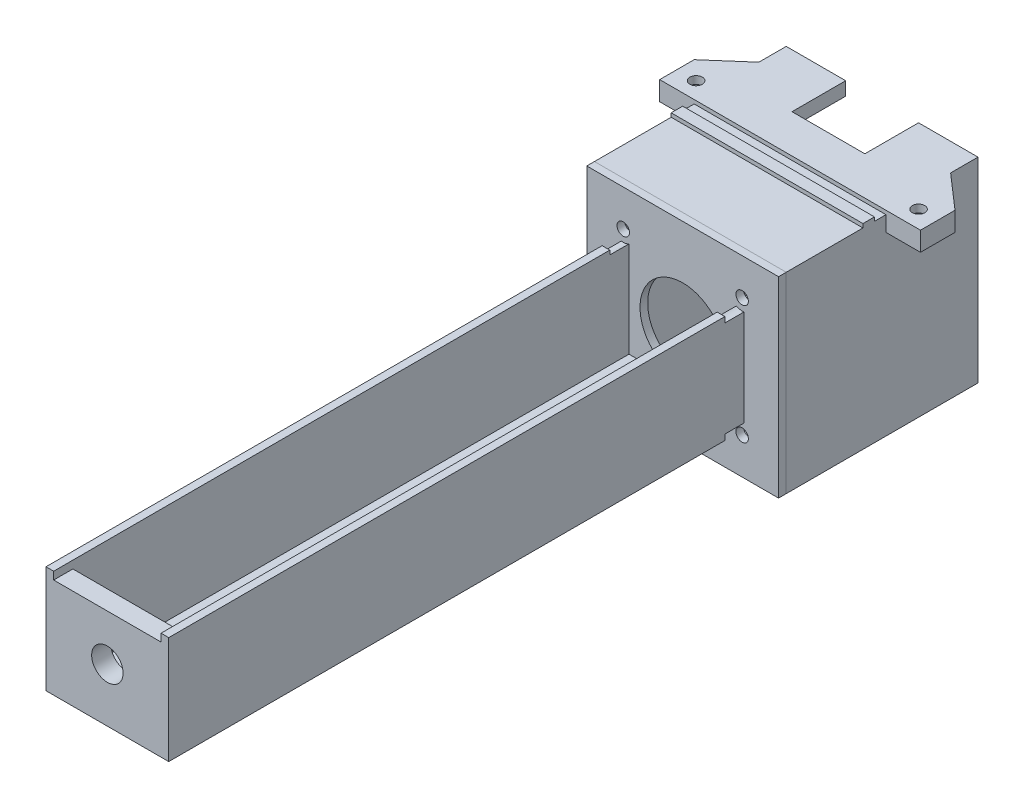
ISO-10303-21;
HEADER;
FILE_DESCRIPTION(('STEP AP214'),'2;1');
FILE_NAME('part.step','',(''),(''),'','','');
FILE_SCHEMA(('AUTOMOTIVE_DESIGN { 1 0 10303 214 1 1 1 1 }'));
ENDSEC;
DATA;
#1=APPLICATION_CONTEXT('core data for automotive mechanical design processes');
#2=APPLICATION_PROTOCOL_DEFINITION('international standard','automotive_design',2000,#1);
#3=PRODUCT_CONTEXT('',#1,'mechanical');
#4=PRODUCT('Part','Part','',(#3));
#5=PRODUCT_RELATED_PRODUCT_CATEGORY('part','',(#4));
#6=PRODUCT_DEFINITION_FORMATION('','',#4);
#7=PRODUCT_DEFINITION_CONTEXT('part definition',#1,'design');
#8=PRODUCT_DEFINITION('design','',#6,#7);
#9=PRODUCT_DEFINITION_SHAPE('','',#8);
#10=(LENGTH_UNIT() NAMED_UNIT(*) SI_UNIT(.MILLI.,.METRE.));
#11=(NAMED_UNIT(*) PLANE_ANGLE_UNIT() SI_UNIT($,.RADIAN.));
#12=(NAMED_UNIT(*) SI_UNIT($,.STERADIAN.) SOLID_ANGLE_UNIT());
#13=UNCERTAINTY_MEASURE_WITH_UNIT(LENGTH_MEASURE(1.E-05),#10,'distance_accuracy_value','');
#14=(GEOMETRIC_REPRESENTATION_CONTEXT(3) GLOBAL_UNCERTAINTY_ASSIGNED_CONTEXT((#13)) GLOBAL_UNIT_ASSIGNED_CONTEXT((#10,
#11,#12)) REPRESENTATION_CONTEXT('',''));
#15=CARTESIAN_POINT('',(0.,0.,0.));
#16=DIRECTION('',(0.,0.,1.));
#17=DIRECTION('',(1.,0.,0.));
#18=AXIS2_PLACEMENT_3D('',#15,#16,#17);
#19=CARTESIAN_POINT('',(-16.,14.,202.));
#20=DIRECTION('',(1.,0.,0.));
#21=DIRECTION('',(0.,1.,0.));
#22=AXIS2_PLACEMENT_3D('',#19,#20,#21);
#23=PLANE('',#22);
#24=DIRECTION('',(0.,0.,-1.));
#25=VECTOR('',#24,1.);
#26=CARTESIAN_POINT('',(-16.,-12.5419601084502,57.));
#27=LINE('',#26,#25);
#28=CARTESIAN_POINT('',(-16.,-12.5419601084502,57.));
#29=VERTEX_POINT('',#28);
#30=CARTESIAN_POINT('',(-16.,-12.5419601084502,52.));
#31=VERTEX_POINT('',#30);
#32=EDGE_CURVE('E347',#29,#31,#27,.T.);
#33=ORIENTED_EDGE('',*,*,#32,.F.);
#34=DIRECTION('',(0.,-1.,0.));
#35=VECTOR('',#34,1.);
#36=CARTESIAN_POINT('',(-16.,14.,57.));
#37=LINE('',#36,#35);
#38=CARTESIAN_POINT('',(-16.,-14.,57.));
#39=VERTEX_POINT('',#38);
#40=EDGE_CURVE('E344',#29,#39,#37,.T.);
#41=ORIENTED_EDGE('',*,*,#40,.T.);
#42=DIRECTION('',(0.,0.,-1.));
#43=VECTOR('',#42,1.);
#44=CARTESIAN_POINT('',(-16.,-14.,202.));
#45=LINE('',#44,#43);
#46=CARTESIAN_POINT('',(-16.,-14.,202.));
#47=VERTEX_POINT('',#46);
#48=EDGE_CURVE('E261',#47,#39,#45,.T.);
#49=ORIENTED_EDGE('',*,*,#48,.F.);
#50=DIRECTION('',(0.,-1.,0.));
#51=VECTOR('',#50,1.);
#52=CARTESIAN_POINT('',(-16.,14.,202.));
#53=LINE('',#52,#51);
#54=CARTESIAN_POINT('',(-16.,14.,202.));
#55=VERTEX_POINT('',#54);
#56=EDGE_CURVE('E380',#55,#47,#53,.T.);
#57=ORIENTED_EDGE('',*,*,#56,.F.);
#58=DIRECTION('',(0.,0.,-1.));
#59=VECTOR('',#58,1.);
#60=CARTESIAN_POINT('',(-16.,14.,202.));
#61=LINE('',#60,#59);
#62=CARTESIAN_POINT('',(-16.,14.,57.));
#63=VERTEX_POINT('',#62);
#64=EDGE_CURVE('E264',#55,#63,#61,.T.);
#65=ORIENTED_EDGE('',*,*,#64,.T.);
#66=DIRECTION('',(0.,-1.,0.));
#67=VECTOR('',#66,1.);
#68=CARTESIAN_POINT('',(-16.,14.,57.));
#69=LINE('',#68,#67);
#70=CARTESIAN_POINT('',(-16.,12.5419601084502,57.));
#71=VERTEX_POINT('',#70);
#72=EDGE_CURVE('E211',#63,#71,#69,.T.);
#73=ORIENTED_EDGE('',*,*,#72,.T.);
#74=DIRECTION('',(0.,0.,-1.));
#75=VECTOR('',#74,1.);
#76=CARTESIAN_POINT('',(-16.,12.5419601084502,57.));
#77=LINE('',#76,#75);
#78=CARTESIAN_POINT('',(-16.,12.5419601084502,52.));
#79=VERTEX_POINT('',#78);
#80=EDGE_CURVE('E197',#79,#71,#77,.F.);
#81=ORIENTED_EDGE('',*,*,#80,.F.);
#82=DIRECTION('',(0.,-1.,0.));
#83=VECTOR('',#82,1.);
#84=CARTESIAN_POINT('',(-16.,14.,52.));
#85=LINE('',#84,#83);
#86=EDGE_CURVE('E209',#79,#31,#85,.T.);
#87=ORIENTED_EDGE('',*,*,#86,.T.);
#88=EDGE_LOOP('',(#33,#41,#49,#57,#65,#73,#81,#87));
#89=FACE_BOUND('',#88,.T.);
#90=ADVANCED_FACE('F47',(#89),#23,.F.);
#91=CARTESIAN_POINT('',(-16.,-14.,202.));
#92=DIRECTION('',(0.,1.,0.));
#93=DIRECTION('',(-1.,0.,0.));
#94=AXIS2_PLACEMENT_3D('',#91,#92,#93);
#95=PLANE('',#94);
#96=DIRECTION('',(0.,0.,-1.));
#97=VECTOR('',#96,1.);
#98=CARTESIAN_POINT('',(-12.9019237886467,-14.,57.));
#99=LINE('',#98,#97);
#100=CARTESIAN_POINT('',(-12.9019237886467,-14.,52.));
#101=VERTEX_POINT('',#100);
#102=CARTESIAN_POINT('',(-12.9019237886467,-14.,57.));
#103=VERTEX_POINT('',#102);
#104=EDGE_CURVE('E12',#101,#103,#99,.F.);
#105=ORIENTED_EDGE('',*,*,#104,.F.);
#106=DIRECTION('',(1.,0.,0.));
#107=VECTOR('',#106,1.);
#108=CARTESIAN_POINT('',(-16.,-14.,52.));
#109=LINE('',#108,#107);
#110=CARTESIAN_POINT('',(12.9019237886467,-14.,52.));
#111=VERTEX_POINT('',#110);
#112=EDGE_CURVE('E219',#101,#111,#109,.T.);
#113=ORIENTED_EDGE('',*,*,#112,.T.);
#114=DIRECTION('',(0.,0.,-1.));
#115=VECTOR('',#114,1.);
#116=CARTESIAN_POINT('',(12.9019237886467,-14.,57.));
#117=LINE('',#116,#115);
#118=CARTESIAN_POINT('',(12.9019237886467,-14.,57.));
#119=VERTEX_POINT('',#118);
#120=EDGE_CURVE('E348',#119,#111,#117,.T.);
#121=ORIENTED_EDGE('',*,*,#120,.F.);
#122=DIRECTION('',(1.,0.,0.));
#123=VECTOR('',#122,1.);
#124=CARTESIAN_POINT('',(-16.,-14.,57.));
#125=LINE('',#124,#123);
#126=CARTESIAN_POINT('',(16.,-14.,57.));
#127=VERTEX_POINT('',#126);
#128=EDGE_CURVE('E352',#119,#127,#125,.T.);
#129=ORIENTED_EDGE('',*,*,#128,.T.);
#130=DIRECTION('',(0.,0.,-1.));
#131=VECTOR('',#130,1.);
#132=CARTESIAN_POINT('',(16.,-14.,202.));
#133=LINE('',#132,#131);
#134=CARTESIAN_POINT('',(16.,-14.,202.));
#135=VERTEX_POINT('',#134);
#136=EDGE_CURVE('E258',#135,#127,#133,.T.);
#137=ORIENTED_EDGE('',*,*,#136,.F.);
#138=DIRECTION('',(1.,0.,0.));
#139=VECTOR('',#138,1.);
#140=CARTESIAN_POINT('',(-16.,-14.,202.));
#141=LINE('',#140,#139);
#142=EDGE_CURVE('E382',#47,#135,#141,.T.);
#143=ORIENTED_EDGE('',*,*,#142,.F.);
#144=ORIENTED_EDGE('',*,*,#48,.T.);
#145=DIRECTION('',(1.,0.,0.));
#146=VECTOR('',#145,1.);
#147=CARTESIAN_POINT('',(-16.,-14.,57.));
#148=LINE('',#147,#146);
#149=EDGE_CURVE('E55',#39,#103,#148,.T.);
#150=ORIENTED_EDGE('',*,*,#149,.T.);
#151=EDGE_LOOP('',(#105,#113,#121,#129,#137,#143,#144,#150));
#152=FACE_BOUND('',#151,.T.);
#153=ADVANCED_FACE('F337',(#152),#95,.F.);
#154=CARTESIAN_POINT('',(16.,-14.,202.));
#155=DIRECTION('',(-1.,0.,0.));
#156=DIRECTION('',(0.,0.,1.));
#157=AXIS2_PLACEMENT_3D('',#154,#155,#156);
#158=PLANE('',#157);
#159=DIRECTION('',(0.,0.,-1.));
#160=VECTOR('',#159,1.);
#161=CARTESIAN_POINT('',(16.,-12.5419601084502,57.));
#162=LINE('',#161,#160);
#163=CARTESIAN_POINT('',(16.,-12.5419601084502,52.));
#164=VERTEX_POINT('',#163);
#165=CARTESIAN_POINT('',(16.,-12.5419601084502,57.));
#166=VERTEX_POINT('',#165);
#167=EDGE_CURVE('E333',#164,#166,#162,.F.);
#168=ORIENTED_EDGE('',*,*,#167,.F.);
#169=DIRECTION('',(0.,1.,0.));
#170=VECTOR('',#169,1.);
#171=CARTESIAN_POINT('',(16.,-14.,52.));
#172=LINE('',#171,#170);
#173=CARTESIAN_POINT('',(16.,12.5419601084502,52.));
#174=VERTEX_POINT('',#173);
#175=EDGE_CURVE('E223',#164,#174,#172,.T.);
#176=ORIENTED_EDGE('',*,*,#175,.T.);
#177=DIRECTION('',(0.,0.,-1.));
#178=VECTOR('',#177,1.);
#179=CARTESIAN_POINT('',(16.,12.5419601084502,57.));
#180=LINE('',#179,#178);
#181=CARTESIAN_POINT('',(16.,12.5419601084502,57.));
#182=VERTEX_POINT('',#181);
#183=EDGE_CURVE('E457',#182,#174,#180,.T.);
#184=ORIENTED_EDGE('',*,*,#183,.F.);
#185=DIRECTION('',(0.,1.,0.));
#186=VECTOR('',#185,1.);
#187=CARTESIAN_POINT('',(16.,-14.,57.));
#188=LINE('',#187,#186);
#189=CARTESIAN_POINT('',(16.,14.,57.));
#190=VERTEX_POINT('',#189);
#191=EDGE_CURVE('E413',#182,#190,#188,.T.);
#192=ORIENTED_EDGE('',*,*,#191,.T.);
#193=DIRECTION('',(0.,0.,-1.));
#194=VECTOR('',#193,1.);
#195=CARTESIAN_POINT('',(16.,14.,202.));
#196=LINE('',#195,#194);
#197=CARTESIAN_POINT('',(16.,14.,202.));
#198=VERTEX_POINT('',#197);
#199=EDGE_CURVE('E255',#198,#190,#196,.T.);
#200=ORIENTED_EDGE('',*,*,#199,.F.);
#201=DIRECTION('',(0.,1.,0.));
#202=VECTOR('',#201,1.);
#203=CARTESIAN_POINT('',(16.,-14.,202.));
#204=LINE('',#203,#202);
#205=EDGE_CURVE('E384',#135,#198,#204,.T.);
#206=ORIENTED_EDGE('',*,*,#205,.F.);
#207=ORIENTED_EDGE('',*,*,#136,.T.);
#208=DIRECTION('',(0.,1.,0.));
#209=VECTOR('',#208,1.);
#210=CARTESIAN_POINT('',(16.,-14.,57.));
#211=LINE('',#210,#209);
#212=EDGE_CURVE('E330',#127,#166,#211,.T.);
#213=ORIENTED_EDGE('',*,*,#212,.T.);
#214=EDGE_LOOP('',(#168,#176,#184,#192,#200,#206,#207,#213));
#215=FACE_BOUND('',#214,.T.);
#216=ADVANCED_FACE('F409',(#215),#158,.F.);
#217=CARTESIAN_POINT('',(14.,14.,202.));
#218=DIRECTION('',(1.,0.,0.));
#219=DIRECTION('',(0.,1.,0.));
#220=AXIS2_PLACEMENT_3D('',#217,#218,#219);
#221=PLANE('',#220);
#222=DIRECTION('',(0.,0.,-1.));
#223=VECTOR('',#222,1.);
#224=CARTESIAN_POINT('',(14.,12.9019237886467,57.));
#225=LINE('',#224,#223);
#226=CARTESIAN_POINT('',(14.,12.9019237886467,52.));
#227=VERTEX_POINT('',#226);
#228=CARTESIAN_POINT('',(14.,12.9019237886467,57.));
#229=VERTEX_POINT('',#228);
#230=EDGE_CURVE('E328',#227,#229,#225,.F.);
#231=ORIENTED_EDGE('',*,*,#230,.F.);
#232=DIRECTION('',(0.,-1.,0.));
#233=VECTOR('',#232,1.);
#234=CARTESIAN_POINT('',(14.,14.,52.));
#235=LINE('',#234,#233);
#236=CARTESIAN_POINT('',(14.,-12.,52.));
#237=VERTEX_POINT('',#236);
#238=EDGE_CURVE('E235',#227,#237,#235,.T.);
#239=ORIENTED_EDGE('',*,*,#238,.T.);
#240=DIRECTION('',(0.,0.,-1.));
#241=VECTOR('',#240,1.);
#242=CARTESIAN_POINT('',(14.,-12.,202.));
#243=LINE('',#242,#241);
#244=CARTESIAN_POINT('',(14.,-12.,197.));
#245=VERTEX_POINT('',#244);
#246=EDGE_CURVE('E249',#245,#237,#243,.T.);
#247=ORIENTED_EDGE('',*,*,#246,.F.);
#248=DIRECTION('',(0.,1.,0.));
#249=VECTOR('',#248,1.);
#250=CARTESIAN_POINT('',(14.,12.0000000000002,197.));
#251=LINE('',#250,#249);
#252=CARTESIAN_POINT('',(14.,12.0000000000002,197.));
#253=VERTEX_POINT('',#252);
#254=EDGE_CURVE('E361',#245,#253,#251,.T.);
#255=ORIENTED_EDGE('',*,*,#254,.T.);
#256=DIRECTION('',(0.,0.,1.));
#257=VECTOR('',#256,1.);
#258=CARTESIAN_POINT('',(14.,12.0000000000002,197.));
#259=LINE('',#258,#257);
#260=CARTESIAN_POINT('',(14.,12.0000000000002,202.));
#261=VERTEX_POINT('',#260);
#262=EDGE_CURVE('E373',#253,#261,#259,.T.);
#263=ORIENTED_EDGE('',*,*,#262,.T.);
#264=DIRECTION('',(0.,-1.,0.));
#265=VECTOR('',#264,1.);
#266=CARTESIAN_POINT('',(14.,14.,202.));
#267=LINE('',#266,#265);
#268=CARTESIAN_POINT('',(14.,14.,202.));
#269=VERTEX_POINT('',#268);
#270=EDGE_CURVE('E387',#269,#261,#267,.T.);
#271=ORIENTED_EDGE('',*,*,#270,.F.);
#272=DIRECTION('',(0.,0.,-1.));
#273=VECTOR('',#272,1.);
#274=CARTESIAN_POINT('',(14.,14.,202.));
#275=LINE('',#274,#273);
#276=CARTESIAN_POINT('',(14.,14.,57.));
#277=VERTEX_POINT('',#276);
#278=EDGE_CURVE('E252',#269,#277,#275,.T.);
#279=ORIENTED_EDGE('',*,*,#278,.T.);
#280=DIRECTION('',(0.,-1.,0.));
#281=VECTOR('',#280,1.);
#282=CARTESIAN_POINT('',(14.,14.,57.));
#283=LINE('',#282,#281);
#284=EDGE_CURVE('E325',#277,#229,#283,.T.);
#285=ORIENTED_EDGE('',*,*,#284,.T.);
#286=EDGE_LOOP('',(#231,#239,#247,#255,#263,#271,#279,#285));
#287=FACE_BOUND('',#286,.T.);
#288=ADVANCED_FACE('F420',(#287),#221,.F.);
#289=CARTESIAN_POINT('',(-14.,-12.,202.));
#290=DIRECTION('',(-1.,0.,0.));
#291=DIRECTION('',(0.,0.,1.));
#292=AXIS2_PLACEMENT_3D('',#289,#290,#291);
#293=PLANE('',#292);
#294=DIRECTION('',(0.,0.,-1.));
#295=VECTOR('',#294,1.);
#296=CARTESIAN_POINT('',(-14.,12.9019237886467,57.));
#297=LINE('',#296,#295);
#298=CARTESIAN_POINT('',(-14.,12.9019237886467,57.));
#299=VERTEX_POINT('',#298);
#300=CARTESIAN_POINT('',(-14.,12.9019237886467,52.));
#301=VERTEX_POINT('',#300);
#302=EDGE_CURVE('E200',#299,#301,#297,.T.);
#303=ORIENTED_EDGE('',*,*,#302,.F.);
#304=DIRECTION('',(0.,1.,0.));
#305=VECTOR('',#304,1.);
#306=CARTESIAN_POINT('',(-14.,-12.,57.));
#307=LINE('',#306,#305);
#308=CARTESIAN_POINT('',(-14.,14.,57.));
#309=VERTEX_POINT('',#308);
#310=EDGE_CURVE('E234',#299,#309,#307,.T.);
#311=ORIENTED_EDGE('',*,*,#310,.T.);
#312=DIRECTION('',(0.,0.,-1.));
#313=VECTOR('',#312,1.);
#314=CARTESIAN_POINT('',(-14.,14.,202.));
#315=LINE('',#314,#313);
#316=CARTESIAN_POINT('',(-14.,14.,202.));
#317=VERTEX_POINT('',#316);
#318=EDGE_CURVE('E244',#317,#309,#315,.T.);
#319=ORIENTED_EDGE('',*,*,#318,.F.);
#320=DIRECTION('',(0.,1.,0.));
#321=VECTOR('',#320,1.);
#322=CARTESIAN_POINT('',(-14.,-12.,202.));
#323=LINE('',#322,#321);
#324=CARTESIAN_POINT('',(-14.,12.0000000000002,202.));
#325=VERTEX_POINT('',#324);
#326=EDGE_CURVE('E229',#325,#317,#323,.T.);
#327=ORIENTED_EDGE('',*,*,#326,.F.);
#328=DIRECTION('',(0.,0.,1.));
#329=VECTOR('',#328,1.);
#330=CARTESIAN_POINT('',(-14.0000000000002,12.0000000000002,197.));
#331=LINE('',#330,#329);
#332=CARTESIAN_POINT('',(-14.0000000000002,12.0000000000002,197.));
#333=VERTEX_POINT('',#332);
#334=EDGE_CURVE('E238',#333,#325,#331,.T.);
#335=ORIENTED_EDGE('',*,*,#334,.F.);
#336=DIRECTION('',(0.,-1.,0.));
#337=VECTOR('',#336,1.);
#338=CARTESIAN_POINT('',(-14.0000000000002,12.0000000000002,197.));
#339=LINE('',#338,#337);
#340=CARTESIAN_POINT('',(-14.0000000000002,-12.,197.));
#341=VERTEX_POINT('',#340);
#342=EDGE_CURVE('E367',#333,#341,#339,.T.);
#343=ORIENTED_EDGE('',*,*,#342,.T.);
#344=DIRECTION('',(0.,0.,-1.));
#345=VECTOR('',#344,1.);
#346=CARTESIAN_POINT('',(-14.,-12.,202.));
#347=LINE('',#346,#345);
#348=CARTESIAN_POINT('',(-14.,-12.,52.));
#349=VERTEX_POINT('',#348);
#350=EDGE_CURVE('E247',#341,#349,#347,.T.);
#351=ORIENTED_EDGE('',*,*,#350,.T.);
#352=DIRECTION('',(0.,1.,0.));
#353=VECTOR('',#352,1.);
#354=CARTESIAN_POINT('',(-14.,-12.,52.));
#355=LINE('',#354,#353);
#356=EDGE_CURVE('E241',#349,#301,#355,.T.);
#357=ORIENTED_EDGE('',*,*,#356,.T.);
#358=EDGE_LOOP('',(#303,#311,#319,#327,#335,#343,#351,#357));
#359=FACE_BOUND('',#358,.T.);
#360=ADVANCED_FACE('F397',(#359),#293,.F.);
#361=CARTESIAN_POINT('',(14.,-12.,202.));
#362=DIRECTION('',(0.,-1.,0.));
#363=DIRECTION('',(1.,0.,0.));
#364=AXIS2_PLACEMENT_3D('',#361,#362,#363);
#365=PLANE('',#364);
#366=DIRECTION('',(1.,0.,0.));
#367=VECTOR('',#366,1.);
#368=CARTESIAN_POINT('',(-14.0000000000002,-12.,197.));
#369=LINE('',#368,#367);
#370=EDGE_CURVE('E370',#341,#245,#369,.T.);
#371=ORIENTED_EDGE('',*,*,#370,.T.);
#372=ORIENTED_EDGE('',*,*,#246,.T.);
#373=DIRECTION('',(-1.,0.,0.));
#374=VECTOR('',#373,1.);
#375=CARTESIAN_POINT('',(14.,-12.,52.));
#376=LINE('',#375,#374);
#377=EDGE_CURVE('E237',#237,#349,#376,.T.);
#378=ORIENTED_EDGE('',*,*,#377,.T.);
#379=ORIENTED_EDGE('',*,*,#350,.F.);
#380=EDGE_LOOP('',(#371,#372,#378,#379));
#381=FACE_BOUND('',#380,.T.);
#382=ADVANCED_FACE('F429',(#381),#365,.F.);
#383=CARTESIAN_POINT('',(0.,0.,52.));
#384=DIRECTION('',(0.,0.,-1.));
#385=DIRECTION('',(-1.,0.,0.));
#386=AXIS2_PLACEMENT_3D('',#383,#384,#385);
#387=PLANE('',#386);
#388=ORIENTED_EDGE('',*,*,#112,.F.);
#389=CARTESIAN_POINT('',(-15.5,-15.5,52.));
#390=DIRECTION('',(0.,0.,1.));
#391=DIRECTION('',(1.,0.,0.));
#392=AXIS2_PLACEMENT_3D('',#389,#390,#391);
#393=CIRCLE('',#392,3.);
#394=EDGE_CURVE('E218',#101,#31,#393,.T.);
#395=ORIENTED_EDGE('',*,*,#394,.T.);
#396=ORIENTED_EDGE('',*,*,#86,.F.);
#397=CARTESIAN_POINT('',(-15.5,15.5,52.));
#398=DIRECTION('',(0.,0.,1.));
#399=DIRECTION('',(1.,0.,0.));
#400=AXIS2_PLACEMENT_3D('',#397,#398,#399);
#401=CIRCLE('',#400,3.);
#402=EDGE_CURVE('E62',#79,#301,#401,.T.);
#403=ORIENTED_EDGE('',*,*,#402,.T.);
#404=ORIENTED_EDGE('',*,*,#356,.F.);
#405=ORIENTED_EDGE('',*,*,#377,.F.);
#406=ORIENTED_EDGE('',*,*,#238,.F.);
#407=CARTESIAN_POINT('',(15.5,15.5,52.));
#408=DIRECTION('',(0.,0.,1.));
#409=DIRECTION('',(1.,0.,0.));
#410=AXIS2_PLACEMENT_3D('',#407,#408,#409);
#411=CIRCLE('',#410,3.);
#412=EDGE_CURVE('E203',#227,#174,#411,.T.);
#413=ORIENTED_EDGE('',*,*,#412,.T.);
#414=ORIENTED_EDGE('',*,*,#175,.F.);
#415=CARTESIAN_POINT('',(15.5,-15.5,52.));
#416=DIRECTION('',(0.,0.,1.));
#417=DIRECTION('',(1.,0.,0.));
#418=AXIS2_PLACEMENT_3D('',#415,#416,#417);
#419=CIRCLE('',#418,3.);
#420=EDGE_CURVE('E441',#164,#111,#419,.T.);
#421=ORIENTED_EDGE('',*,*,#420,.T.);
#422=EDGE_LOOP('',(#388,#395,#396,#403,#404,#405,#406,#413,#414,#421));
#423=FACE_BOUND('',#422,.T.);
#424=CARTESIAN_POINT('',(0.,0.,52.));
#425=DIRECTION('',(0.,0.,1.));
#426=DIRECTION('',(1.,0.,0.));
#427=AXIS2_PLACEMENT_3D('',#424,#425,#426);
#428=CIRCLE('',#427,11.125);
#429=CARTESIAN_POINT('',(11.125,0.,52.));
#430=VERTEX_POINT('',#429);
#431=EDGE_CURVE('E267',#430,#430,#428,.T.);
#432=ORIENTED_EDGE('',*,*,#431,.F.);
#433=EDGE_LOOP('',(#432));
#434=FACE_BOUND('',#433,.T.);
#435=DIRECTION('',(0.,1.,0.));
#436=VECTOR('',#435,1.);
#437=CARTESIAN_POINT('',(25.,-25.,52.));
#438=LINE('',#437,#436);
#439=CARTESIAN_POINT('',(25.,-25.,52.));
#440=VERTEX_POINT('',#439);
#441=CARTESIAN_POINT('',(25.,25.,52.));
#442=VERTEX_POINT('',#441);
#443=EDGE_CURVE('E297',#440,#442,#438,.T.);
#444=ORIENTED_EDGE('',*,*,#443,.T.);
#445=DIRECTION('',(-1.,0.,0.));
#446=VECTOR('',#445,1.);
#447=CARTESIAN_POINT('',(-25.,25.,52.));
#448=LINE('',#447,#446);
#449=CARTESIAN_POINT('',(-25.,25.,52.));
#450=VERTEX_POINT('',#449);
#451=EDGE_CURVE('E300',#442,#450,#448,.T.);
#452=ORIENTED_EDGE('',*,*,#451,.T.);
#453=DIRECTION('',(0.,-1.,0.));
#454=VECTOR('',#453,1.);
#455=CARTESIAN_POINT('',(-25.,-25.,52.));
#456=LINE('',#455,#454);
#457=CARTESIAN_POINT('',(-25.,-25.,52.));
#458=VERTEX_POINT('',#457);
#459=EDGE_CURVE('E303',#450,#458,#456,.T.);
#460=ORIENTED_EDGE('',*,*,#459,.T.);
#461=DIRECTION('',(1.,0.,0.));
#462=VECTOR('',#461,1.);
#463=CARTESIAN_POINT('',(-25.,-25.,52.));
#464=LINE('',#463,#462);
#465=EDGE_CURVE('E305',#458,#440,#464,.T.);
#466=ORIENTED_EDGE('',*,*,#465,.T.);
#467=EDGE_LOOP('',(#444,#452,#460,#466));
#468=FACE_BOUND('',#467,.T.);
#469=CARTESIAN_POINT('',(-15.5,15.5,52.));
#470=DIRECTION('',(0.,0.,1.));
#471=DIRECTION('',(1.,0.,0.));
#472=AXIS2_PLACEMENT_3D('',#469,#470,#471);
#473=CIRCLE('',#472,1.625);
#474=CARTESIAN_POINT('',(-13.875,15.5,52.));
#475=VERTEX_POINT('',#474);
#476=EDGE_CURVE('E291',#475,#475,#473,.T.);
#477=ORIENTED_EDGE('',*,*,#476,.F.);
#478=EDGE_LOOP('',(#477));
#479=FACE_BOUND('',#478,.T.);
#480=CARTESIAN_POINT('',(15.5,15.5,52.));
#481=DIRECTION('',(0.,0.,1.));
#482=DIRECTION('',(1.,0.,0.));
#483=AXIS2_PLACEMENT_3D('',#480,#481,#482);
#484=CIRCLE('',#483,1.625);
#485=CARTESIAN_POINT('',(17.125,15.5,52.));
#486=VERTEX_POINT('',#485);
#487=EDGE_CURVE('E285',#486,#486,#484,.T.);
#488=ORIENTED_EDGE('',*,*,#487,.F.);
#489=EDGE_LOOP('',(#488));
#490=FACE_BOUND('',#489,.T.);
#491=CARTESIAN_POINT('',(15.5,-15.5,52.));
#492=DIRECTION('',(0.,0.,1.));
#493=DIRECTION('',(1.,0.,0.));
#494=AXIS2_PLACEMENT_3D('',#491,#492,#493);
#495=CIRCLE('',#494,1.625);
#496=CARTESIAN_POINT('',(17.125,-15.5,52.));
#497=VERTEX_POINT('',#496);
#498=EDGE_CURVE('E279',#497,#497,#495,.T.);
#499=ORIENTED_EDGE('',*,*,#498,.F.);
#500=EDGE_LOOP('',(#499));
#501=FACE_BOUND('',#500,.T.);
#502=CARTESIAN_POINT('',(-15.5,-15.5,52.));
#503=DIRECTION('',(0.,0.,1.));
#504=DIRECTION('',(1.,0.,0.));
#505=AXIS2_PLACEMENT_3D('',#502,#503,#504);
#506=CIRCLE('',#505,1.625);
#507=CARTESIAN_POINT('',(-13.875,-15.5,52.));
#508=VERTEX_POINT('',#507);
#509=EDGE_CURVE('E273',#508,#508,#506,.T.);
#510=ORIENTED_EDGE('',*,*,#509,.F.);
#511=EDGE_LOOP('',(#510));
#512=FACE_BOUND('',#511,.T.);
#513=ADVANCED_FACE('F216',(#423,#434,#468,#479,#490,#501,#512),#387,.F.);
#514=CARTESIAN_POINT('',(0.,0.,50.));
#515=DIRECTION('',(0.,0.,-1.));
#516=DIRECTION('',(-1.,0.,0.));
#517=AXIS2_PLACEMENT_3D('',#514,#515,#516);
#518=PLANE('',#517);
#519=CARTESIAN_POINT('',(-15.5,-15.5,50.));
#520=DIRECTION('',(0.,0.,1.));
#521=DIRECTION('',(1.,0.,0.));
#522=AXIS2_PLACEMENT_3D('',#519,#520,#521);
#523=CIRCLE('',#522,1.625);
#524=CARTESIAN_POINT('',(-13.875,-15.5,50.));
#525=VERTEX_POINT('',#524);
#526=EDGE_CURVE('E270',#525,#525,#523,.T.);
#527=ORIENTED_EDGE('',*,*,#526,.T.);
#528=EDGE_LOOP('',(#527));
#529=FACE_BOUND('',#528,.T.);
#530=CARTESIAN_POINT('',(15.5,15.5,50.));
#531=DIRECTION('',(0.,0.,1.));
#532=DIRECTION('',(1.,0.,0.));
#533=AXIS2_PLACEMENT_3D('',#530,#531,#532);
#534=CIRCLE('',#533,1.625);
#535=CARTESIAN_POINT('',(17.125,15.5,50.));
#536=VERTEX_POINT('',#535);
#537=EDGE_CURVE('E282',#536,#536,#534,.T.);
#538=ORIENTED_EDGE('',*,*,#537,.T.);
#539=EDGE_LOOP('',(#538));
#540=FACE_BOUND('',#539,.T.);
#541=DIRECTION('',(0.,1.,0.));
#542=VECTOR('',#541,1.);
#543=CARTESIAN_POINT('',(25.,-25.,50.));
#544=LINE('',#543,#542);
#545=CARTESIAN_POINT('',(25.,-25.,50.));
#546=VERTEX_POINT('',#545);
#547=CARTESIAN_POINT('',(25.,25.,50.));
#548=VERTEX_POINT('',#547);
#549=EDGE_CURVE('E294',#546,#548,#544,.T.);
#550=ORIENTED_EDGE('',*,*,#549,.F.);
#551=DIRECTION('',(1.,0.,0.));
#552=VECTOR('',#551,1.);
#553=CARTESIAN_POINT('',(-25.,-25.,50.));
#554=LINE('',#553,#552);
#555=CARTESIAN_POINT('',(-25.,-25.,50.));
#556=VERTEX_POINT('',#555);
#557=EDGE_CURVE('E301',#556,#546,#554,.T.);
#558=ORIENTED_EDGE('',*,*,#557,.F.);
#559=DIRECTION('',(0.,-1.,0.));
#560=VECTOR('',#559,1.);
#561=CARTESIAN_POINT('',(-25.,-25.,50.));
#562=LINE('',#561,#560);
#563=CARTESIAN_POINT('',(-25.,25.,50.));
#564=VERTEX_POINT('',#563);
#565=EDGE_CURVE('E312',#564,#556,#562,.T.);
#566=ORIENTED_EDGE('',*,*,#565,.F.);
#567=DIRECTION('',(-1.,0.,0.));
#568=VECTOR('',#567,1.);
#569=CARTESIAN_POINT('',(-25.,25.,50.));
#570=LINE('',#569,#568);
#571=EDGE_CURVE('E310',#548,#564,#570,.T.);
#572=ORIENTED_EDGE('',*,*,#571,.F.);
#573=EDGE_LOOP('',(#550,#558,#566,#572));
#574=FACE_BOUND('',#573,.T.);
#575=CARTESIAN_POINT('',(-15.5,15.5,50.));
#576=DIRECTION('',(0.,0.,1.));
#577=DIRECTION('',(1.,0.,0.));
#578=AXIS2_PLACEMENT_3D('',#575,#576,#577);
#579=CIRCLE('',#578,1.625);
#580=CARTESIAN_POINT('',(-13.875,15.5,50.));
#581=VERTEX_POINT('',#580);
#582=EDGE_CURVE('E288',#581,#581,#579,.T.);
#583=ORIENTED_EDGE('',*,*,#582,.T.);
#584=EDGE_LOOP('',(#583));
#585=FACE_BOUND('',#584,.T.);
#586=CARTESIAN_POINT('',(15.5,-15.5,50.));
#587=DIRECTION('',(0.,0.,1.));
#588=DIRECTION('',(1.,0.,0.));
#589=AXIS2_PLACEMENT_3D('',#586,#587,#588);
#590=CIRCLE('',#589,1.625);
#591=CARTESIAN_POINT('',(17.125,-15.5,50.));
#592=VERTEX_POINT('',#591);
#593=EDGE_CURVE('E276',#592,#592,#590,.T.);
#594=ORIENTED_EDGE('',*,*,#593,.T.);
#595=EDGE_LOOP('',(#594));
#596=FACE_BOUND('',#595,.T.);
#597=CARTESIAN_POINT('',(0.,0.,50.));
#598=DIRECTION('',(0.,0.,1.));
#599=DIRECTION('',(1.,0.,0.));
#600=AXIS2_PLACEMENT_3D('',#597,#598,#599);
#601=CIRCLE('',#600,11.125);
#602=CARTESIAN_POINT('',(11.125,0.,50.));
#603=VERTEX_POINT('',#602);
#604=EDGE_CURVE('E266',#603,#603,#601,.T.);
#605=ORIENTED_EDGE('',*,*,#604,.T.);
#606=EDGE_LOOP('',(#605));
#607=FACE_BOUND('',#606,.T.);
#608=ADVANCED_FACE('F506',(#529,#540,#574,#585,#596,#607),#518,.T.);
#609=CARTESIAN_POINT('',(25.,-25.,52.));
#610=DIRECTION('',(-1.,0.,0.));
#611=DIRECTION('',(0.,0.,1.));
#612=AXIS2_PLACEMENT_3D('',#609,#610,#611);
#613=PLANE('',#612);
#614=ORIENTED_EDGE('',*,*,#549,.T.);
#615=DIRECTION('',(0.,0.,-1.));
#616=VECTOR('',#615,1.);
#617=CARTESIAN_POINT('',(25.,25.,52.));
#618=LINE('',#617,#616);
#619=EDGE_CURVE('E220',#442,#548,#618,.T.);
#620=ORIENTED_EDGE('',*,*,#619,.F.);
#621=ORIENTED_EDGE('',*,*,#443,.F.);
#622=DIRECTION('',(0.,0.,-1.));
#623=VECTOR('',#622,1.);
#624=CARTESIAN_POINT('',(25.,-25.,52.));
#625=LINE('',#624,#623);
#626=EDGE_CURVE('E307',#440,#546,#625,.T.);
#627=ORIENTED_EDGE('',*,*,#626,.T.);
#628=EDGE_LOOP('',(#614,#620,#621,#627));
#629=FACE_BOUND('',#628,.T.);
#630=ADVANCED_FACE('F49',(#629),#613,.F.);
#631=CARTESIAN_POINT('',(-25.,25.,52.));
#632=DIRECTION('',(0.,-1.,0.));
#633=DIRECTION('',(0.,0.,-1.));
#634=AXIS2_PLACEMENT_3D('',#631,#632,#633);
#635=PLANE('',#634);
#636=ORIENTED_EDGE('',*,*,#571,.T.);
#637=DIRECTION('',(0.,0.,-1.));
#638=VECTOR('',#637,1.);
#639=CARTESIAN_POINT('',(-25.,25.,52.));
#640=LINE('',#639,#638);
#641=EDGE_CURVE('E226',#450,#564,#640,.T.);
#642=ORIENTED_EDGE('',*,*,#641,.F.);
#643=ORIENTED_EDGE('',*,*,#451,.F.);
#644=ORIENTED_EDGE('',*,*,#619,.T.);
#645=EDGE_LOOP('',(#636,#642,#643,#644));
#646=FACE_BOUND('',#645,.T.);
#647=ADVANCED_FACE('F515',(#646),#635,.F.);
#648=CARTESIAN_POINT('',(-25.,-25.,52.));
#649=DIRECTION('',(1.,0.,0.));
#650=DIRECTION('',(0.,0.,-1.));
#651=AXIS2_PLACEMENT_3D('',#648,#649,#650);
#652=PLANE('',#651);
#653=ORIENTED_EDGE('',*,*,#565,.T.);
#654=DIRECTION('',(0.,0.,-1.));
#655=VECTOR('',#654,1.);
#656=CARTESIAN_POINT('',(-25.,-25.,52.));
#657=LINE('',#656,#655);
#658=EDGE_CURVE('E317',#458,#556,#657,.T.);
#659=ORIENTED_EDGE('',*,*,#658,.F.);
#660=ORIENTED_EDGE('',*,*,#459,.F.);
#661=ORIENTED_EDGE('',*,*,#641,.T.);
#662=EDGE_LOOP('',(#653,#659,#660,#661));
#663=FACE_BOUND('',#662,.T.);
#664=ADVANCED_FACE('F512',(#663),#652,.F.);
#665=CARTESIAN_POINT('',(-25.,-25.,52.));
#666=DIRECTION('',(0.,1.,0.));
#667=DIRECTION('',(0.,0.,1.));
#668=AXIS2_PLACEMENT_3D('',#665,#666,#667);
#669=PLANE('',#668);
#670=ORIENTED_EDGE('',*,*,#557,.T.);
#671=ORIENTED_EDGE('',*,*,#626,.F.);
#672=ORIENTED_EDGE('',*,*,#465,.F.);
#673=ORIENTED_EDGE('',*,*,#658,.T.);
#674=EDGE_LOOP('',(#670,#671,#672,#673));
#675=FACE_BOUND('',#674,.T.);
#676=ADVANCED_FACE('F502',(#675),#669,.F.);
#677=CARTESIAN_POINT('',(-15.5,15.5,52.));
#678=DIRECTION('',(0.,0.,-1.));
#679=DIRECTION('',(-1.,0.,0.));
#680=AXIS2_PLACEMENT_3D('',#677,#678,#679);
#681=CYLINDRICAL_SURFACE('',#680,1.625);
#682=ORIENTED_EDGE('',*,*,#476,.T.);
#683=EDGE_LOOP('',(#682));
#684=FACE_BOUND('',#683,.T.);
#685=ORIENTED_EDGE('',*,*,#582,.F.);
#686=EDGE_LOOP('',(#685));
#687=FACE_BOUND('',#686,.T.);
#688=ADVANCED_FACE('F498',(#684,#687),#681,.F.);
#689=CARTESIAN_POINT('',(15.5,15.5,52.));
#690=DIRECTION('',(0.,0.,-1.));
#691=DIRECTION('',(-1.,0.,0.));
#692=AXIS2_PLACEMENT_3D('',#689,#690,#691);
#693=CYLINDRICAL_SURFACE('',#692,1.625);
#694=ORIENTED_EDGE('',*,*,#487,.T.);
#695=EDGE_LOOP('',(#694));
#696=FACE_BOUND('',#695,.T.);
#697=ORIENTED_EDGE('',*,*,#537,.F.);
#698=EDGE_LOOP('',(#697));
#699=FACE_BOUND('',#698,.T.);
#700=ADVANCED_FACE('F494',(#696,#699),#693,.F.);
#701=CARTESIAN_POINT('',(15.5,-15.5,52.));
#702=DIRECTION('',(0.,0.,-1.));
#703=DIRECTION('',(-1.,0.,0.));
#704=AXIS2_PLACEMENT_3D('',#701,#702,#703);
#705=CYLINDRICAL_SURFACE('',#704,1.625);
#706=ORIENTED_EDGE('',*,*,#498,.T.);
#707=EDGE_LOOP('',(#706));
#708=FACE_BOUND('',#707,.T.);
#709=ORIENTED_EDGE('',*,*,#593,.F.);
#710=EDGE_LOOP('',(#709));
#711=FACE_BOUND('',#710,.T.);
#712=ADVANCED_FACE('F490',(#708,#711),#705,.F.);
#713=CARTESIAN_POINT('',(-15.5,-15.5,52.));
#714=DIRECTION('',(0.,0.,-1.));
#715=DIRECTION('',(-1.,0.,0.));
#716=AXIS2_PLACEMENT_3D('',#713,#714,#715);
#717=CYLINDRICAL_SURFACE('',#716,1.625);
#718=ORIENTED_EDGE('',*,*,#509,.T.);
#719=EDGE_LOOP('',(#718));
#720=FACE_BOUND('',#719,.T.);
#721=ORIENTED_EDGE('',*,*,#526,.F.);
#722=EDGE_LOOP('',(#721));
#723=FACE_BOUND('',#722,.T.);
#724=ADVANCED_FACE('F486',(#720,#723),#717,.F.);
#725=CARTESIAN_POINT('',(0.,0.,52.));
#726=DIRECTION('',(0.,0.,-1.));
#727=DIRECTION('',(-1.,0.,0.));
#728=AXIS2_PLACEMENT_3D('',#725,#726,#727);
#729=CYLINDRICAL_SURFACE('',#728,11.125);
#730=ORIENTED_EDGE('',*,*,#431,.T.);
#731=EDGE_LOOP('',(#730));
#732=FACE_BOUND('',#731,.T.);
#733=ORIENTED_EDGE('',*,*,#604,.F.);
#734=EDGE_LOOP('',(#733));
#735=FACE_BOUND('',#734,.T.);
#736=ADVANCED_FACE('F483',(#732,#735),#729,.F.);
#737=CARTESIAN_POINT('',(-14.,14.,202.));
#738=DIRECTION('',(0.,-1.,0.));
#739=DIRECTION('',(0.,0.,-1.));
#740=AXIS2_PLACEMENT_3D('',#737,#738,#739);
#741=PLANE('',#740);
#742=ORIENTED_EDGE('',*,*,#318,.T.);
#743=DIRECTION('',(-1.,0.,0.));
#744=VECTOR('',#743,1.);
#745=CARTESIAN_POINT('',(-14.,14.,57.));
#746=LINE('',#745,#744);
#747=EDGE_CURVE('E401',#309,#63,#746,.T.);
#748=ORIENTED_EDGE('',*,*,#747,.T.);
#749=ORIENTED_EDGE('',*,*,#64,.F.);
#750=DIRECTION('',(-1.,0.,0.));
#751=VECTOR('',#750,1.);
#752=CARTESIAN_POINT('',(-14.,14.,202.));
#753=LINE('',#752,#751);
#754=EDGE_CURVE('E243',#317,#55,#753,.T.);
#755=ORIENTED_EDGE('',*,*,#754,.F.);
#756=EDGE_LOOP('',(#742,#748,#749,#755));
#757=FACE_BOUND('',#756,.T.);
#758=ADVANCED_FACE('F400',(#757),#741,.F.);
#759=CARTESIAN_POINT('',(16.,14.,202.));
#760=DIRECTION('',(0.,-1.,0.));
#761=DIRECTION('',(0.,0.,-1.));
#762=AXIS2_PLACEMENT_3D('',#759,#760,#761);
#763=PLANE('',#762);
#764=ORIENTED_EDGE('',*,*,#199,.T.);
#765=DIRECTION('',(-1.,0.,0.));
#766=VECTOR('',#765,1.);
#767=CARTESIAN_POINT('',(16.,14.,57.));
#768=LINE('',#767,#766);
#769=EDGE_CURVE('E212',#190,#277,#768,.T.);
#770=ORIENTED_EDGE('',*,*,#769,.T.);
#771=ORIENTED_EDGE('',*,*,#278,.F.);
#772=DIRECTION('',(-1.,0.,0.));
#773=VECTOR('',#772,1.);
#774=CARTESIAN_POINT('',(16.,14.,202.));
#775=LINE('',#774,#773);
#776=EDGE_CURVE('E386',#198,#269,#775,.T.);
#777=ORIENTED_EDGE('',*,*,#776,.F.);
#778=EDGE_LOOP('',(#764,#770,#771,#777));
#779=FACE_BOUND('',#778,.T.);
#780=ADVANCED_FACE('F417',(#779),#763,.F.);
#781=CARTESIAN_POINT('',(0.,0.,202.));
#782=DIRECTION('',(0.,0.,1.));
#783=DIRECTION('',(1.,0.,0.));
#784=AXIS2_PLACEMENT_3D('',#781,#782,#783);
#785=PLANE('',#784);
#786=ORIENTED_EDGE('',*,*,#270,.T.);
#787=DIRECTION('',(-1.,0.,0.));
#788=VECTOR('',#787,1.);
#789=CARTESIAN_POINT('',(-14.0000000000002,12.0000000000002,202.));
#790=LINE('',#789,#788);
#791=EDGE_CURVE('E70',#261,#325,#790,.T.);
#792=ORIENTED_EDGE('',*,*,#791,.T.);
#793=ORIENTED_EDGE('',*,*,#326,.T.);
#794=ORIENTED_EDGE('',*,*,#754,.T.);
#795=ORIENTED_EDGE('',*,*,#56,.T.);
#796=ORIENTED_EDGE('',*,*,#142,.T.);
#797=ORIENTED_EDGE('',*,*,#205,.T.);
#798=ORIENTED_EDGE('',*,*,#776,.T.);
#799=EDGE_LOOP('',(#786,#792,#793,#794,#795,#796,#797,#798));
#800=FACE_BOUND('',#799,.T.);
#801=CARTESIAN_POINT('',(-1.18672307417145E-13,0.,202.));
#802=DIRECTION('',(0.,0.,1.));
#803=DIRECTION('',(1.,0.,0.));
#804=AXIS2_PLACEMENT_3D('',#801,#802,#803);
#805=CIRCLE('',#804,4.10000000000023);
#806=CARTESIAN_POINT('',(4.10000000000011,0.,202.));
#807=VERTEX_POINT('',#806);
#808=EDGE_CURVE('E350',#807,#807,#805,.T.);
#809=ORIENTED_EDGE('',*,*,#808,.F.);
#810=EDGE_LOOP('',(#809));
#811=FACE_BOUND('',#810,.T.);
#812=ADVANCED_FACE('F391',(#800,#811),#785,.T.);
#813=CARTESIAN_POINT('',(-14.0000000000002,12.0000000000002,197.));
#814=DIRECTION('',(0.,1.,0.));
#815=DIRECTION('',(0.,0.,1.));
#816=AXIS2_PLACEMENT_3D('',#813,#814,#815);
#817=PLANE('',#816);
#818=ORIENTED_EDGE('',*,*,#791,.F.);
#819=ORIENTED_EDGE('',*,*,#262,.F.);
#820=DIRECTION('',(-1.,0.,0.));
#821=VECTOR('',#820,1.);
#822=CARTESIAN_POINT('',(-14.0000000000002,12.0000000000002,197.));
#823=LINE('',#822,#821);
#824=EDGE_CURVE('E364',#253,#333,#823,.T.);
#825=ORIENTED_EDGE('',*,*,#824,.T.);
#826=ORIENTED_EDGE('',*,*,#334,.T.);
#827=EDGE_LOOP('',(#818,#819,#825,#826));
#828=FACE_BOUND('',#827,.T.);
#829=ADVANCED_FACE('F424',(#828),#817,.T.);
#830=CARTESIAN_POINT('',(0.,0.,197.));
#831=DIRECTION('',(0.,0.,1.));
#832=DIRECTION('',(1.,0.,0.));
#833=AXIS2_PLACEMENT_3D('',#830,#831,#832);
#834=PLANE('',#833);
#835=CARTESIAN_POINT('',(-1.18672307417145E-13,0.,197.));
#836=DIRECTION('',(0.,0.,1.));
#837=DIRECTION('',(1.,0.,0.));
#838=AXIS2_PLACEMENT_3D('',#835,#836,#837);
#839=CIRCLE('',#838,4.10000000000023);
#840=CARTESIAN_POINT('',(4.10000000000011,0.,197.));
#841=VERTEX_POINT('',#840);
#842=EDGE_CURVE('E356',#841,#841,#839,.T.);
#843=ORIENTED_EDGE('',*,*,#842,.T.);
#844=EDGE_LOOP('',(#843));
#845=FACE_BOUND('',#844,.T.);
#846=ORIENTED_EDGE('',*,*,#254,.F.);
#847=ORIENTED_EDGE('',*,*,#370,.F.);
#848=ORIENTED_EDGE('',*,*,#342,.F.);
#849=ORIENTED_EDGE('',*,*,#824,.F.);
#850=EDGE_LOOP('',(#846,#847,#848,#849));
#851=FACE_BOUND('',#850,.T.);
#852=ADVANCED_FACE('F426',(#845,#851),#834,.F.);
#853=CARTESIAN_POINT('',(-1.18672307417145E-13,0.,197.));
#854=DIRECTION('',(0.,0.,1.));
#855=DIRECTION('',(1.,0.,0.));
#856=AXIS2_PLACEMENT_3D('',#853,#854,#855);
#857=CYLINDRICAL_SURFACE('',#856,4.10000000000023);
#858=ORIENTED_EDGE('',*,*,#842,.F.);
#859=EDGE_LOOP('',(#858));
#860=FACE_BOUND('',#859,.T.);
#861=ORIENTED_EDGE('',*,*,#808,.T.);
#862=EDGE_LOOP('',(#861));
#863=FACE_BOUND('',#862,.T.);
#864=ADVANCED_FACE('F608',(#860,#863),#857,.F.);
#865=CARTESIAN_POINT('',(-15.5,15.5,57.));
#866=DIRECTION('',(0.,0.,-1.));
#867=DIRECTION('',(-1.,0.,0.));
#868=AXIS2_PLACEMENT_3D('',#865,#866,#867);
#869=CYLINDRICAL_SURFACE('',#868,3.);
#870=ORIENTED_EDGE('',*,*,#80,.T.);
#871=CARTESIAN_POINT('',(-15.5,15.5,57.));
#872=DIRECTION('',(0.,0.,1.));
#873=DIRECTION('',(1.,0.,0.));
#874=AXIS2_PLACEMENT_3D('',#871,#872,#873);
#875=CIRCLE('',#874,3.);
#876=EDGE_CURVE('E202',#71,#299,#875,.T.);
#877=ORIENTED_EDGE('',*,*,#876,.T.);
#878=ORIENTED_EDGE('',*,*,#302,.T.);
#879=ORIENTED_EDGE('',*,*,#402,.F.);
#880=EDGE_LOOP('',(#870,#877,#878,#879));
#881=FACE_BOUND('',#880,.T.);
#882=ADVANCED_FACE('F195',(#881),#869,.F.);
#883=CARTESIAN_POINT('',(-15.5,15.5,57.));
#884=DIRECTION('',(0.,0.,1.));
#885=DIRECTION('',(1.,0.,0.));
#886=AXIS2_PLACEMENT_3D('',#883,#884,#885);
#887=PLANE('',#886);
#888=ORIENTED_EDGE('',*,*,#747,.F.);
#889=ORIENTED_EDGE('',*,*,#310,.F.);
#890=ORIENTED_EDGE('',*,*,#876,.F.);
#891=ORIENTED_EDGE('',*,*,#72,.F.);
#892=EDGE_LOOP('',(#888,#889,#890,#891));
#893=FACE_BOUND('',#892,.T.);
#894=ADVANCED_FACE('F769',(#893),#887,.F.);
#895=CARTESIAN_POINT('',(15.5,15.5,57.));
#896=DIRECTION('',(0.,0.,-1.));
#897=DIRECTION('',(-1.,0.,0.));
#898=AXIS2_PLACEMENT_3D('',#895,#896,#897);
#899=CYLINDRICAL_SURFACE('',#898,3.);
#900=ORIENTED_EDGE('',*,*,#183,.T.);
#901=ORIENTED_EDGE('',*,*,#412,.F.);
#902=ORIENTED_EDGE('',*,*,#230,.T.);
#903=CARTESIAN_POINT('',(15.5,15.5,57.));
#904=DIRECTION('',(0.,0.,1.));
#905=DIRECTION('',(1.,0.,0.));
#906=AXIS2_PLACEMENT_3D('',#903,#904,#905);
#907=CIRCLE('',#906,3.);
#908=EDGE_CURVE('E438',#229,#182,#907,.T.);
#909=ORIENTED_EDGE('',*,*,#908,.T.);
#910=EDGE_LOOP('',(#900,#901,#902,#909));
#911=FACE_BOUND('',#910,.T.);
#912=ADVANCED_FACE('F437',(#911),#899,.F.);
#913=CARTESIAN_POINT('',(15.5,15.5,57.));
#914=DIRECTION('',(0.,0.,1.));
#915=DIRECTION('',(1.,0.,0.));
#916=AXIS2_PLACEMENT_3D('',#913,#914,#915);
#917=PLANE('',#916);
#918=ORIENTED_EDGE('',*,*,#908,.F.);
#919=ORIENTED_EDGE('',*,*,#284,.F.);
#920=ORIENTED_EDGE('',*,*,#769,.F.);
#921=ORIENTED_EDGE('',*,*,#191,.F.);
#922=EDGE_LOOP('',(#918,#919,#920,#921));
#923=FACE_BOUND('',#922,.T.);
#924=ADVANCED_FACE('F440',(#923),#917,.F.);
#925=CARTESIAN_POINT('',(15.5,-15.5,57.));
#926=DIRECTION('',(0.,0.,-1.));
#927=DIRECTION('',(-1.,0.,0.));
#928=AXIS2_PLACEMENT_3D('',#925,#926,#927);
#929=CYLINDRICAL_SURFACE('',#928,3.);
#930=ORIENTED_EDGE('',*,*,#120,.T.);
#931=ORIENTED_EDGE('',*,*,#420,.F.);
#932=ORIENTED_EDGE('',*,*,#167,.T.);
#933=CARTESIAN_POINT('',(15.5,-15.5,57.));
#934=DIRECTION('',(0.,0.,1.));
#935=DIRECTION('',(1.,0.,0.));
#936=AXIS2_PLACEMENT_3D('',#933,#934,#935);
#937=CIRCLE('',#936,3.);
#938=EDGE_CURVE('E445',#166,#119,#937,.T.);
#939=ORIENTED_EDGE('',*,*,#938,.T.);
#940=EDGE_LOOP('',(#930,#931,#932,#939));
#941=FACE_BOUND('',#940,.T.);
#942=ADVANCED_FACE('F459',(#941),#929,.F.);
#943=CARTESIAN_POINT('',(15.5,-15.5,57.));
#944=DIRECTION('',(0.,0.,1.));
#945=DIRECTION('',(1.,0.,0.));
#946=AXIS2_PLACEMENT_3D('',#943,#944,#945);
#947=PLANE('',#946);
#948=ORIENTED_EDGE('',*,*,#938,.F.);
#949=ORIENTED_EDGE('',*,*,#212,.F.);
#950=ORIENTED_EDGE('',*,*,#128,.F.);
#951=EDGE_LOOP('',(#948,#949,#950));
#952=FACE_BOUND('',#951,.T.);
#953=ADVANCED_FACE('F462',(#952),#947,.F.);
#954=CARTESIAN_POINT('',(-15.5,-15.5,57.));
#955=DIRECTION('',(0.,0.,-1.));
#956=DIRECTION('',(-1.,0.,0.));
#957=AXIS2_PLACEMENT_3D('',#954,#955,#956);
#958=CYLINDRICAL_SURFACE('',#957,3.);
#959=ORIENTED_EDGE('',*,*,#32,.T.);
#960=ORIENTED_EDGE('',*,*,#394,.F.);
#961=ORIENTED_EDGE('',*,*,#104,.T.);
#962=CARTESIAN_POINT('',(-15.5,-15.5,57.));
#963=DIRECTION('',(0.,0.,1.));
#964=DIRECTION('',(1.,0.,0.));
#965=AXIS2_PLACEMENT_3D('',#962,#963,#964);
#966=CIRCLE('',#965,3.);
#967=EDGE_CURVE('E346',#103,#29,#966,.T.);
#968=ORIENTED_EDGE('',*,*,#967,.T.);
#969=EDGE_LOOP('',(#959,#960,#961,#968));
#970=FACE_BOUND('',#969,.T.);
#971=ADVANCED_FACE('F464',(#970),#958,.F.);
#972=CARTESIAN_POINT('',(-15.5,-15.5,57.));
#973=DIRECTION('',(0.,0.,1.));
#974=DIRECTION('',(1.,0.,0.));
#975=AXIS2_PLACEMENT_3D('',#972,#973,#974);
#976=PLANE('',#975);
#977=ORIENTED_EDGE('',*,*,#967,.F.);
#978=ORIENTED_EDGE('',*,*,#149,.F.);
#979=ORIENTED_EDGE('',*,*,#40,.F.);
#980=EDGE_LOOP('',(#977,#978,#979));
#981=FACE_BOUND('',#980,.T.);
#982=ADVANCED_FACE('F343',(#981),#976,.F.);
#983=CLOSED_SHELL('',(#90,#153,#216,#288,#360,#382,#513,#608,#630,#647,#664,#676,#688,#700,#712,
#724,#736,#758,#780,#812,#829,#852,#864,#882,#894,#912,#924,#942,#953,#971,#982));
#984=MANIFOLD_SOLID_BREP('B2',#983);
#985=CARTESIAN_POINT('',(-25.,-25.,50.));
#986=DIRECTION('',(1.,0.,0.));
#987=DIRECTION('',(0.,0.,-1.));
#988=AXIS2_PLACEMENT_3D('',#985,#986,#987);
#989=PLANE('',#988);
#990=DIRECTION('',(0.,1.,0.));
#991=VECTOR('',#990,1.);
#992=CARTESIAN_POINT('',(-25.,21.,24.));
#993=LINE('',#992,#991);
#994=CARTESIAN_POINT('',(-25.,21.,24.));
#995=VERTEX_POINT('',#994);
#996=CARTESIAN_POINT('',(-25.,25.,24.));
#997=VERTEX_POINT('',#996);
#998=EDGE_CURVE('E1028',#995,#997,#993,.T.);
#999=ORIENTED_EDGE('',*,*,#998,.F.);
#1000=DIRECTION('',(0.,0.,-1.));
#1001=VECTOR('',#1000,1.);
#1002=CARTESIAN_POINT('',(-25.,21.,24.));
#1003=LINE('',#1002,#1001);
#1004=CARTESIAN_POINT('',(-25.,21.,7.13772315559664));
#1005=VERTEX_POINT('',#1004);
#1006=EDGE_CURVE('E1032',#995,#1005,#1003,.T.);
#1007=ORIENTED_EDGE('',*,*,#1006,.T.);
#1008=DIRECTION('',(0.,1.,0.));
#1009=VECTOR('',#1008,1.);
#1010=CARTESIAN_POINT('',(-25.,21.,7.13772315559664));
#1011=LINE('',#1010,#1009);
#1012=CARTESIAN_POINT('',(-25.,26.,7.13772315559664));
#1013=VERTEX_POINT('',#1012);
#1014=EDGE_CURVE('E1043',#1005,#1013,#1011,.T.);
#1015=ORIENTED_EDGE('',*,*,#1014,.T.);
#1016=DIRECTION('',(0.,0.,1.));
#1017=VECTOR('',#1016,1.);
#1018=CARTESIAN_POINT('',(-25.,26.,0.));
#1019=LINE('',#1018,#1017);
#1020=CARTESIAN_POINT('',(-25.,26.,0.));
#1021=VERTEX_POINT('',#1020);
#1022=EDGE_CURVE('E1018',#1021,#1013,#1019,.T.);
#1023=ORIENTED_EDGE('',*,*,#1022,.F.);
#1024=DIRECTION('',(0.,-1.,0.));
#1025=VECTOR('',#1024,1.);
#1026=CARTESIAN_POINT('',(-25.,-25.,0.));
#1027=LINE('',#1026,#1025);
#1028=CARTESIAN_POINT('',(-25.,-25.,0.));
#1029=VERTEX_POINT('',#1028);
#1030=EDGE_CURVE('E1165',#1021,#1029,#1027,.T.);
#1031=ORIENTED_EDGE('',*,*,#1030,.T.);
#1032=DIRECTION('',(0.,0.,-1.));
#1033=VECTOR('',#1032,1.);
#1034=CARTESIAN_POINT('',(-25.,-25.,50.));
#1035=LINE('',#1034,#1033);
#1036=CARTESIAN_POINT('',(-25.,-25.,50.));
#1037=VERTEX_POINT('',#1036);
#1038=EDGE_CURVE('E1170',#1037,#1029,#1035,.T.);
#1039=ORIENTED_EDGE('',*,*,#1038,.F.);
#1040=DIRECTION('',(0.,-1.,0.));
#1041=VECTOR('',#1040,1.);
#1042=CARTESIAN_POINT('',(-25.,-25.,50.));
#1043=LINE('',#1042,#1041);
#1044=CARTESIAN_POINT('',(-25.,25.,50.));
#1045=VERTEX_POINT('',#1044);
#1046=EDGE_CURVE('E1158',#1045,#1037,#1043,.T.);
#1047=ORIENTED_EDGE('',*,*,#1046,.F.);
#1048=DIRECTION('',(0.,0.,-1.));
#1049=VECTOR('',#1048,1.);
#1050=CARTESIAN_POINT('',(-25.,25.,50.));
#1051=LINE('',#1050,#1049);
#1052=CARTESIAN_POINT('',(-25.,25.,30.));
#1053=VERTEX_POINT('',#1052);
#1054=EDGE_CURVE('E1174',#1045,#1053,#1051,.T.);
#1055=ORIENTED_EDGE('',*,*,#1054,.T.);
#1056=DIRECTION('',(0.,-1.,0.));
#1057=VECTOR('',#1056,1.);
#1058=CARTESIAN_POINT('',(-25.,26.,30.));
#1059=LINE('',#1058,#1057);
#1060=CARTESIAN_POINT('',(-25.,26.,30.));
#1061=VERTEX_POINT('',#1060);
#1062=EDGE_CURVE('E1072',#1061,#1053,#1059,.T.);
#1063=ORIENTED_EDGE('',*,*,#1062,.F.);
#1064=DIRECTION('',(0.,0.,1.));
#1065=VECTOR('',#1064,1.);
#1066=CARTESIAN_POINT('',(-25.,26.,30.));
#1067=LINE('',#1066,#1065);
#1068=CARTESIAN_POINT('',(-25.,26.,27.));
#1069=VERTEX_POINT('',#1068);
#1070=EDGE_CURVE('E1086',#1069,#1061,#1067,.T.);
#1071=ORIENTED_EDGE('',*,*,#1070,.F.);
#1072=DIRECTION('',(0.,-1.,0.));
#1073=VECTOR('',#1072,1.);
#1074=CARTESIAN_POINT('',(-25.,26.,27.));
#1075=LINE('',#1074,#1073);
#1076=CARTESIAN_POINT('',(-25.,25.,27.));
#1077=VERTEX_POINT('',#1076);
#1078=EDGE_CURVE('E1070',#1069,#1077,#1075,.T.);
#1079=ORIENTED_EDGE('',*,*,#1078,.T.);
#1080=EDGE_CURVE('E1173',#1077,#997,#1051,.T.);
#1081=ORIENTED_EDGE('',*,*,#1080,.T.);
#1082=EDGE_LOOP('',(#999,#1007,#1015,#1023,#1031,#1039,#1047,#1055,#1063,#1071,#1079,#1081));
#1083=FACE_BOUND('',#1082,.T.);
#1084=ADVANCED_FACE('F844',(#1083),#989,.F.);
#1085=CARTESIAN_POINT('',(25.,-25.,50.));
#1086=DIRECTION('',(-1.,0.,0.));
#1087=DIRECTION('',(0.,0.,1.));
#1088=AXIS2_PLACEMENT_3D('',#1085,#1086,#1087);
#1089=PLANE('',#1088);
#1090=DIRECTION('',(0.,1.,0.));
#1091=VECTOR('',#1090,1.);
#1092=CARTESIAN_POINT('',(25.,21.,7.13772315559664));
#1093=LINE('',#1092,#1091);
#1094=CARTESIAN_POINT('',(25.,21.,7.13772315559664));
#1095=VERTEX_POINT('',#1094);
#1096=CARTESIAN_POINT('',(25.,26.,7.13772315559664));
#1097=VERTEX_POINT('',#1096);
#1098=EDGE_CURVE('E869',#1095,#1097,#1093,.T.);
#1099=ORIENTED_EDGE('',*,*,#1098,.F.);
#1100=DIRECTION('',(0.,0.,1.));
#1101=VECTOR('',#1100,1.);
#1102=CARTESIAN_POINT('',(25.,21.,24.));
#1103=LINE('',#1102,#1101);
#1104=CARTESIAN_POINT('',(25.,21.,24.));
#1105=VERTEX_POINT('',#1104);
#1106=EDGE_CURVE('E1047',#1095,#1105,#1103,.T.);
#1107=ORIENTED_EDGE('',*,*,#1106,.T.);
#1108=DIRECTION('',(0.,1.,0.));
#1109=VECTOR('',#1108,1.);
#1110=CARTESIAN_POINT('',(25.,21.,24.));
#1111=LINE('',#1110,#1109);
#1112=CARTESIAN_POINT('',(25.,25.,24.));
#1113=VERTEX_POINT('',#1112);
#1114=EDGE_CURVE('E1058',#1105,#1113,#1111,.T.);
#1115=ORIENTED_EDGE('',*,*,#1114,.T.);
#1116=DIRECTION('',(0.,0.,-1.));
#1117=VECTOR('',#1116,1.);
#1118=CARTESIAN_POINT('',(25.,25.,50.));
#1119=LINE('',#1118,#1117);
#1120=CARTESIAN_POINT('',(25.,25.,27.));
#1121=VERTEX_POINT('',#1120);
#1122=EDGE_CURVE('E1177',#1121,#1113,#1119,.T.);
#1123=ORIENTED_EDGE('',*,*,#1122,.F.);
#1124=DIRECTION('',(0.,-1.,0.));
#1125=VECTOR('',#1124,1.);
#1126=CARTESIAN_POINT('',(25.,26.,27.));
#1127=LINE('',#1126,#1125);
#1128=CARTESIAN_POINT('',(25.,26.,27.));
#1129=VERTEX_POINT('',#1128);
#1130=EDGE_CURVE('E1063',#1129,#1121,#1127,.T.);
#1131=ORIENTED_EDGE('',*,*,#1130,.F.);
#1132=DIRECTION('',(0.,0.,-1.));
#1133=VECTOR('',#1132,1.);
#1134=CARTESIAN_POINT('',(25.,26.,30.));
#1135=LINE('',#1134,#1133);
#1136=CARTESIAN_POINT('',(25.,26.,30.));
#1137=VERTEX_POINT('',#1136);
#1138=EDGE_CURVE('E1081',#1137,#1129,#1135,.T.);
#1139=ORIENTED_EDGE('',*,*,#1138,.F.);
#1140=DIRECTION('',(0.,-1.,0.));
#1141=VECTOR('',#1140,1.);
#1142=CARTESIAN_POINT('',(25.,26.,30.));
#1143=LINE('',#1142,#1141);
#1144=CARTESIAN_POINT('',(25.,25.,30.));
#1145=VERTEX_POINT('',#1144);
#1146=EDGE_CURVE('E1074',#1137,#1145,#1143,.T.);
#1147=ORIENTED_EDGE('',*,*,#1146,.T.);
#1148=CARTESIAN_POINT('',(25.,25.,50.));
#1149=VERTEX_POINT('',#1148);
#1150=EDGE_CURVE('E1178',#1149,#1145,#1119,.T.);
#1151=ORIENTED_EDGE('',*,*,#1150,.F.);
#1152=DIRECTION('',(0.,1.,0.));
#1153=VECTOR('',#1152,1.);
#1154=CARTESIAN_POINT('',(25.,-25.,50.));
#1155=LINE('',#1154,#1153);
#1156=CARTESIAN_POINT('',(25.,-25.,50.));
#1157=VERTEX_POINT('',#1156);
#1158=EDGE_CURVE('E1152',#1157,#1149,#1155,.T.);
#1159=ORIENTED_EDGE('',*,*,#1158,.F.);
#1160=DIRECTION('',(0.,0.,-1.));
#1161=VECTOR('',#1160,1.);
#1162=CARTESIAN_POINT('',(25.,-25.,50.));
#1163=LINE('',#1162,#1161);
#1164=CARTESIAN_POINT('',(25.,-25.,0.));
#1165=VERTEX_POINT('',#1164);
#1166=EDGE_CURVE('E1162',#1157,#1165,#1163,.T.);
#1167=ORIENTED_EDGE('',*,*,#1166,.T.);
#1168=DIRECTION('',(0.,1.,0.));
#1169=VECTOR('',#1168,1.);
#1170=CARTESIAN_POINT('',(25.,-25.,0.));
#1171=LINE('',#1170,#1169);
#1172=CARTESIAN_POINT('',(25.,26.,0.));
#1173=VERTEX_POINT('',#1172);
#1174=EDGE_CURVE('E1151',#1165,#1173,#1171,.T.);
#1175=ORIENTED_EDGE('',*,*,#1174,.T.);
#1176=DIRECTION('',(0.,0.,-1.));
#1177=VECTOR('',#1176,1.);
#1178=CARTESIAN_POINT('',(25.,26.,14.));
#1179=LINE('',#1178,#1177);
#1180=EDGE_CURVE('E1092',#1097,#1173,#1179,.T.);
#1181=ORIENTED_EDGE('',*,*,#1180,.F.);
#1182=EDGE_LOOP('',(#1099,#1107,#1115,#1123,#1131,#1139,#1147,#1151,#1159,#1167,#1175,#1181));
#1183=FACE_BOUND('',#1182,.T.);
#1184=ADVANCED_FACE('F846',(#1183),#1089,.F.);
#1185=CARTESIAN_POINT('',(-25.,25.,50.));
#1186=DIRECTION('',(0.,-1.,0.));
#1187=DIRECTION('',(0.,0.,-1.));
#1188=AXIS2_PLACEMENT_3D('',#1185,#1186,#1187);
#1189=PLANE('',#1188);
#1190=DIRECTION('',(-1.,0.,0.));
#1191=VECTOR('',#1190,1.);
#1192=CARTESIAN_POINT('',(-25.,25.,27.));
#1193=LINE('',#1192,#1191);
#1194=EDGE_CURVE('E1080',#1121,#1077,#1193,.T.);
#1195=ORIENTED_EDGE('',*,*,#1194,.F.);
#1196=ORIENTED_EDGE('',*,*,#1122,.T.);
#1197=DIRECTION('',(1.,0.,0.));
#1198=VECTOR('',#1197,1.);
#1199=CARTESIAN_POINT('',(-25.,25.,24.));
#1200=LINE('',#1199,#1198);
#1201=EDGE_CURVE('E1084',#997,#1113,#1200,.T.);
#1202=ORIENTED_EDGE('',*,*,#1201,.F.);
#1203=ORIENTED_EDGE('',*,*,#1080,.F.);
#1204=EDGE_LOOP('',(#1195,#1196,#1202,#1203));
#1205=FACE_BOUND('',#1204,.T.);
#1206=ADVANCED_FACE('F1225',(#1205),#1189,.F.);
#1207=DIRECTION('',(1.,0.,0.));
#1208=VECTOR('',#1207,1.);
#1209=CARTESIAN_POINT('',(-25.,25.,30.));
#1210=LINE('',#1209,#1208);
#1211=EDGE_CURVE('E1078',#1053,#1145,#1210,.T.);
#1212=ORIENTED_EDGE('',*,*,#1211,.F.);
#1213=ORIENTED_EDGE('',*,*,#1054,.F.);
#1214=DIRECTION('',(-1.,0.,0.));
#1215=VECTOR('',#1214,1.);
#1216=CARTESIAN_POINT('',(-25.,25.,50.));
#1217=LINE('',#1216,#1215);
#1218=EDGE_CURVE('E1155',#1149,#1045,#1217,.T.);
#1219=ORIENTED_EDGE('',*,*,#1218,.F.);
#1220=ORIENTED_EDGE('',*,*,#1150,.T.);
#1221=EDGE_LOOP('',(#1212,#1213,#1219,#1220));
#1222=FACE_BOUND('',#1221,.T.);
#1223=ADVANCED_FACE('F1259',(#1222),#1189,.F.);
#1224=CARTESIAN_POINT('',(0.,0.,50.));
#1225=DIRECTION('',(0.,0.,-1.));
#1226=DIRECTION('',(-1.,0.,0.));
#1227=AXIS2_PLACEMENT_3D('',#1224,#1225,#1226);
#1228=PLANE('',#1227);
#1229=ORIENTED_EDGE('',*,*,#1158,.T.);
#1230=ORIENTED_EDGE('',*,*,#1218,.T.);
#1231=ORIENTED_EDGE('',*,*,#1046,.T.);
#1232=DIRECTION('',(1.,0.,0.));
#1233=VECTOR('',#1232,1.);
#1234=CARTESIAN_POINT('',(-25.,-25.,50.));
#1235=LINE('',#1234,#1233);
#1236=EDGE_CURVE('E1160',#1037,#1157,#1235,.T.);
#1237=ORIENTED_EDGE('',*,*,#1236,.T.);
#1238=EDGE_LOOP('',(#1229,#1230,#1231,#1237));
#1239=FACE_BOUND('',#1238,.T.);
#1240=DIRECTION('',(0.,1.,0.));
#1241=VECTOR('',#1240,1.);
#1242=CARTESIAN_POINT('',(22.5,-22.5,50.));
#1243=LINE('',#1242,#1241);
#1244=CARTESIAN_POINT('',(22.5,-22.5,50.));
#1245=VERTEX_POINT('',#1244);
#1246=CARTESIAN_POINT('',(22.5,22.5,50.));
#1247=VERTEX_POINT('',#1246);
#1248=EDGE_CURVE('E1119',#1245,#1247,#1243,.T.);
#1249=ORIENTED_EDGE('',*,*,#1248,.F.);
#1250=DIRECTION('',(1.,0.,0.));
#1251=VECTOR('',#1250,1.);
#1252=CARTESIAN_POINT('',(-22.5,-22.5,50.));
#1253=LINE('',#1252,#1251);
#1254=CARTESIAN_POINT('',(-22.5,-22.5,50.));
#1255=VERTEX_POINT('',#1254);
#1256=EDGE_CURVE('E1127',#1255,#1245,#1253,.T.);
#1257=ORIENTED_EDGE('',*,*,#1256,.F.);
#1258=DIRECTION('',(0.,-1.,0.));
#1259=VECTOR('',#1258,1.);
#1260=CARTESIAN_POINT('',(-22.5,-22.5,50.));
#1261=LINE('',#1260,#1259);
#1262=CARTESIAN_POINT('',(-22.5,22.5,50.));
#1263=VERTEX_POINT('',#1262);
#1264=EDGE_CURVE('E1124',#1263,#1255,#1261,.T.);
#1265=ORIENTED_EDGE('',*,*,#1264,.F.);
#1266=DIRECTION('',(-1.,0.,0.));
#1267=VECTOR('',#1266,1.);
#1268=CARTESIAN_POINT('',(-22.5,22.5,50.));
#1269=LINE('',#1268,#1267);
#1270=EDGE_CURVE('E1121',#1247,#1263,#1269,.T.);
#1271=ORIENTED_EDGE('',*,*,#1270,.F.);
#1272=EDGE_LOOP('',(#1249,#1257,#1265,#1271));
#1273=FACE_BOUND('',#1272,.T.);
#1274=ADVANCED_FACE('F1263',(#1239,#1273),#1228,.F.);
#1275=CARTESIAN_POINT('',(0.,0.,0.));
#1276=DIRECTION('',(0.,0.,-1.));
#1277=DIRECTION('',(-1.,0.,0.));
#1278=AXIS2_PLACEMENT_3D('',#1275,#1276,#1277);
#1279=PLANE('',#1278);
#1280=DIRECTION('',(0.,1.,0.));
#1281=VECTOR('',#1280,1.);
#1282=CARTESIAN_POINT('',(9.49999999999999,21.,0.));
#1283=LINE('',#1282,#1281);
#1284=CARTESIAN_POINT('',(9.49999999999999,22.5,0.));
#1285=VERTEX_POINT('',#1284);
#1286=CARTESIAN_POINT('',(9.49999999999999,26.,0.));
#1287=VERTEX_POINT('',#1286);
#1288=EDGE_CURVE('E1111',#1285,#1287,#1283,.T.);
#1289=ORIENTED_EDGE('',*,*,#1288,.T.);
#1290=DIRECTION('',(-1.,0.,0.));
#1291=VECTOR('',#1290,1.);
#1292=CARTESIAN_POINT('',(9.49999999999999,26.,0.));
#1293=LINE('',#1292,#1291);
#1294=EDGE_CURVE('E1094',#1173,#1287,#1293,.T.);
#1295=ORIENTED_EDGE('',*,*,#1294,.F.);
#1296=ORIENTED_EDGE('',*,*,#1174,.F.);
#1297=DIRECTION('',(1.,0.,0.));
#1298=VECTOR('',#1297,1.);
#1299=CARTESIAN_POINT('',(-25.,-25.,0.));
#1300=LINE('',#1299,#1298);
#1301=EDGE_CURVE('E1156',#1029,#1165,#1300,.T.);
#1302=ORIENTED_EDGE('',*,*,#1301,.F.);
#1303=ORIENTED_EDGE('',*,*,#1030,.F.);
#1304=DIRECTION('',(-1.,0.,0.));
#1305=VECTOR('',#1304,1.);
#1306=CARTESIAN_POINT('',(-25.,26.,0.));
#1307=LINE('',#1306,#1305);
#1308=CARTESIAN_POINT('',(-9.5,26.,0.));
#1309=VERTEX_POINT('',#1308);
#1310=EDGE_CURVE('E1106',#1309,#1021,#1307,.T.);
#1311=ORIENTED_EDGE('',*,*,#1310,.F.);
#1312=DIRECTION('',(0.,1.,0.));
#1313=VECTOR('',#1312,1.);
#1314=CARTESIAN_POINT('',(-9.5,21.,0.));
#1315=LINE('',#1314,#1313);
#1316=CARTESIAN_POINT('',(-9.5,22.5,0.));
#1317=VERTEX_POINT('',#1316);
#1318=EDGE_CURVE('E1017',#1317,#1309,#1315,.T.);
#1319=ORIENTED_EDGE('',*,*,#1318,.F.);
#1320=DIRECTION('',(-1.,0.,0.));
#1321=VECTOR('',#1320,1.);
#1322=CARTESIAN_POINT('',(-22.5,22.5,0.));
#1323=LINE('',#1322,#1321);
#1324=CARTESIAN_POINT('',(-22.5,22.5,0.));
#1325=VERTEX_POINT('',#1324);
#1326=EDGE_CURVE('E1132',#1317,#1325,#1323,.T.);
#1327=ORIENTED_EDGE('',*,*,#1326,.T.);
#1328=DIRECTION('',(0.,-1.,0.));
#1329=VECTOR('',#1328,1.);
#1330=CARTESIAN_POINT('',(-22.5,-22.5,0.));
#1331=LINE('',#1330,#1329);
#1332=CARTESIAN_POINT('',(-22.5,-22.5,0.));
#1333=VERTEX_POINT('',#1332);
#1334=EDGE_CURVE('E1136',#1325,#1333,#1331,.T.);
#1335=ORIENTED_EDGE('',*,*,#1334,.T.);
#1336=DIRECTION('',(1.,0.,0.));
#1337=VECTOR('',#1336,1.);
#1338=CARTESIAN_POINT('',(-22.5,-22.5,0.));
#1339=LINE('',#1338,#1337);
#1340=CARTESIAN_POINT('',(22.5,-22.5,0.));
#1341=VERTEX_POINT('',#1340);
#1342=EDGE_CURVE('E1122',#1333,#1341,#1339,.T.);
#1343=ORIENTED_EDGE('',*,*,#1342,.T.);
#1344=DIRECTION('',(0.,1.,0.));
#1345=VECTOR('',#1344,1.);
#1346=CARTESIAN_POINT('',(22.5,-22.5,0.));
#1347=LINE('',#1346,#1345);
#1348=CARTESIAN_POINT('',(22.5,22.5,0.));
#1349=VERTEX_POINT('',#1348);
#1350=EDGE_CURVE('E1113',#1341,#1349,#1347,.T.);
#1351=ORIENTED_EDGE('',*,*,#1350,.T.);
#1352=EDGE_CURVE('E1133',#1349,#1285,#1323,.T.);
#1353=ORIENTED_EDGE('',*,*,#1352,.T.);
#1354=EDGE_LOOP('',(#1289,#1295,#1296,#1302,#1303,#1311,#1319,#1327,#1335,#1343,#1351,#1353));
#1355=FACE_BOUND('',#1354,.T.);
#1356=ADVANCED_FACE('F1268',(#1355),#1279,.T.);
#1357=CARTESIAN_POINT('',(-25.,-25.,50.));
#1358=DIRECTION('',(0.,1.,0.));
#1359=DIRECTION('',(0.,0.,1.));
#1360=AXIS2_PLACEMENT_3D('',#1357,#1358,#1359);
#1361=PLANE('',#1360);
#1362=ORIENTED_EDGE('',*,*,#1301,.T.);
#1363=ORIENTED_EDGE('',*,*,#1166,.F.);
#1364=ORIENTED_EDGE('',*,*,#1236,.F.);
#1365=ORIENTED_EDGE('',*,*,#1038,.T.);
#1366=EDGE_LOOP('',(#1362,#1363,#1364,#1365));
#1367=FACE_BOUND('',#1366,.T.);
#1368=ADVANCED_FACE('F1256',(#1367),#1361,.F.);
#1369=CARTESIAN_POINT('',(22.5,-22.5,50.));
#1370=DIRECTION('',(-1.,0.,0.));
#1371=DIRECTION('',(0.,0.,1.));
#1372=AXIS2_PLACEMENT_3D('',#1369,#1370,#1371);
#1373=PLANE('',#1372);
#1374=ORIENTED_EDGE('',*,*,#1350,.F.);
#1375=DIRECTION('',(0.,0.,-1.));
#1376=VECTOR('',#1375,1.);
#1377=CARTESIAN_POINT('',(22.5,-22.5,50.));
#1378=LINE('',#1377,#1376);
#1379=EDGE_CURVE('E1129',#1245,#1341,#1378,.T.);
#1380=ORIENTED_EDGE('',*,*,#1379,.F.);
#1381=ORIENTED_EDGE('',*,*,#1248,.T.);
#1382=DIRECTION('',(0.,0.,-1.));
#1383=VECTOR('',#1382,1.);
#1384=CARTESIAN_POINT('',(22.5,22.5,50.));
#1385=LINE('',#1384,#1383);
#1386=EDGE_CURVE('E1148',#1247,#1349,#1385,.T.);
#1387=ORIENTED_EDGE('',*,*,#1386,.T.);
#1388=EDGE_LOOP('',(#1374,#1380,#1381,#1387));
#1389=FACE_BOUND('',#1388,.T.);
#1390=ADVANCED_FACE('F1323',(#1389),#1373,.T.);
#1391=CARTESIAN_POINT('',(-22.5,22.5,50.));
#1392=DIRECTION('',(0.,-1.,0.));
#1393=DIRECTION('',(0.,0.,-1.));
#1394=AXIS2_PLACEMENT_3D('',#1391,#1392,#1393);
#1395=PLANE('',#1394);
#1396=DIRECTION('',(0.,0.,1.));
#1397=VECTOR('',#1396,1.);
#1398=CARTESIAN_POINT('',(9.50000000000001,22.5,50.));
#1399=LINE('',#1398,#1397);
#1400=CARTESIAN_POINT('',(9.5,22.5,14.));
#1401=VERTEX_POINT('',#1400);
#1402=EDGE_CURVE('E45',#1285,#1401,#1399,.T.);
#1403=ORIENTED_EDGE('',*,*,#1402,.F.);
#1404=ORIENTED_EDGE('',*,*,#1352,.F.);
#1405=ORIENTED_EDGE('',*,*,#1386,.F.);
#1406=ORIENTED_EDGE('',*,*,#1270,.T.);
#1407=DIRECTION('',(0.,0.,-1.));
#1408=VECTOR('',#1407,1.);
#1409=CARTESIAN_POINT('',(-22.5,22.5,50.));
#1410=LINE('',#1409,#1408);
#1411=EDGE_CURVE('E1145',#1263,#1325,#1410,.T.);
#1412=ORIENTED_EDGE('',*,*,#1411,.T.);
#1413=ORIENTED_EDGE('',*,*,#1326,.F.);
#1414=DIRECTION('',(0.,0.,-1.));
#1415=VECTOR('',#1414,1.);
#1416=CARTESIAN_POINT('',(-9.5,22.5,50.));
#1417=LINE('',#1416,#1415);
#1418=CARTESIAN_POINT('',(-9.5,22.5,14.));
#1419=VERTEX_POINT('',#1418);
#1420=EDGE_CURVE('E1181',#1419,#1317,#1417,.T.);
#1421=ORIENTED_EDGE('',*,*,#1420,.F.);
#1422=DIRECTION('',(-1.,0.,0.));
#1423=VECTOR('',#1422,1.);
#1424=CARTESIAN_POINT('',(-22.5,22.5,14.));
#1425=LINE('',#1424,#1423);
#1426=EDGE_CURVE('E853',#1401,#1419,#1425,.T.);
#1427=ORIENTED_EDGE('',*,*,#1426,.F.);
#1428=EDGE_LOOP('',(#1403,#1404,#1405,#1406,#1412,#1413,#1421,#1427));
#1429=FACE_BOUND('',#1428,.T.);
#1430=ADVANCED_FACE('F1319',(#1429),#1395,.T.);
#1431=CARTESIAN_POINT('',(-22.5,-22.5,50.));
#1432=DIRECTION('',(1.,0.,0.));
#1433=DIRECTION('',(0.,0.,-1.));
#1434=AXIS2_PLACEMENT_3D('',#1431,#1432,#1433);
#1435=PLANE('',#1434);
#1436=ORIENTED_EDGE('',*,*,#1334,.F.);
#1437=ORIENTED_EDGE('',*,*,#1411,.F.);
#1438=ORIENTED_EDGE('',*,*,#1264,.T.);
#1439=DIRECTION('',(0.,0.,-1.));
#1440=VECTOR('',#1439,1.);
#1441=CARTESIAN_POINT('',(-22.5,-22.5,50.));
#1442=LINE('',#1441,#1440);
#1443=EDGE_CURVE('E1143',#1255,#1333,#1442,.T.);
#1444=ORIENTED_EDGE('',*,*,#1443,.T.);
#1445=EDGE_LOOP('',(#1436,#1437,#1438,#1444));
#1446=FACE_BOUND('',#1445,.T.);
#1447=ADVANCED_FACE('F1315',(#1446),#1435,.T.);
#1448=CARTESIAN_POINT('',(-22.5,-22.5,50.));
#1449=DIRECTION('',(0.,1.,0.));
#1450=DIRECTION('',(0.,0.,1.));
#1451=AXIS2_PLACEMENT_3D('',#1448,#1449,#1450);
#1452=PLANE('',#1451);
#1453=ORIENTED_EDGE('',*,*,#1342,.F.);
#1454=ORIENTED_EDGE('',*,*,#1443,.F.);
#1455=ORIENTED_EDGE('',*,*,#1256,.T.);
#1456=ORIENTED_EDGE('',*,*,#1379,.T.);
#1457=EDGE_LOOP('',(#1453,#1454,#1455,#1456));
#1458=FACE_BOUND('',#1457,.T.);
#1459=ADVANCED_FACE('F1305',(#1458),#1452,.T.);
#1460=CARTESIAN_POINT('',(9.49999999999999,21.,0.));
#1461=DIRECTION('',(1.,0.,0.));
#1462=DIRECTION('',(0.,0.,-1.));
#1463=AXIS2_PLACEMENT_3D('',#1460,#1461,#1462);
#1464=PLANE('',#1463);
#1465=ORIENTED_EDGE('',*,*,#1402,.T.);
#1466=DIRECTION('',(0.,1.,0.));
#1467=VECTOR('',#1466,1.);
#1468=CARTESIAN_POINT('',(9.5,21.,14.));
#1469=LINE('',#1468,#1467);
#1470=CARTESIAN_POINT('',(9.49999999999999,26.,14.));
#1471=VERTEX_POINT('',#1470);
#1472=EDGE_CURVE('E1114',#1401,#1471,#1469,.T.);
#1473=ORIENTED_EDGE('',*,*,#1472,.T.);
#1474=DIRECTION('',(0.,0.,1.));
#1475=VECTOR('',#1474,1.);
#1476=CARTESIAN_POINT('',(9.49999999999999,26.,0.));
#1477=LINE('',#1476,#1475);
#1478=EDGE_CURVE('E1097',#1287,#1471,#1477,.T.);
#1479=ORIENTED_EDGE('',*,*,#1478,.F.);
#1480=ORIENTED_EDGE('',*,*,#1288,.F.);
#1481=EDGE_LOOP('',(#1465,#1473,#1479,#1480));
#1482=FACE_BOUND('',#1481,.T.);
#1483=ADVANCED_FACE('F1301',(#1482),#1464,.F.);
#1484=CARTESIAN_POINT('',(9.5,21.,14.));
#1485=DIRECTION('',(0.,0.,1.));
#1486=DIRECTION('',(1.,0.,0.));
#1487=AXIS2_PLACEMENT_3D('',#1484,#1485,#1486);
#1488=PLANE('',#1487);
#1489=ORIENTED_EDGE('',*,*,#1426,.T.);
#1490=DIRECTION('',(0.,1.,0.));
#1491=VECTOR('',#1490,1.);
#1492=CARTESIAN_POINT('',(-9.5,21.,14.));
#1493=LINE('',#1492,#1491);
#1494=CARTESIAN_POINT('',(-9.5,26.,14.));
#1495=VERTEX_POINT('',#1494);
#1496=EDGE_CURVE('E1116',#1419,#1495,#1493,.T.);
#1497=ORIENTED_EDGE('',*,*,#1496,.T.);
#1498=DIRECTION('',(-1.,0.,0.));
#1499=VECTOR('',#1498,1.);
#1500=CARTESIAN_POINT('',(-9.5,26.,14.));
#1501=LINE('',#1500,#1499);
#1502=EDGE_CURVE('E1100',#1471,#1495,#1501,.T.);
#1503=ORIENTED_EDGE('',*,*,#1502,.F.);
#1504=ORIENTED_EDGE('',*,*,#1472,.F.);
#1505=EDGE_LOOP('',(#1489,#1497,#1503,#1504));
#1506=FACE_BOUND('',#1505,.T.);
#1507=ADVANCED_FACE('F1304',(#1506),#1488,.F.);
#1508=CARTESIAN_POINT('',(-9.5,21.,14.));
#1509=DIRECTION('',(-1.,0.,0.));
#1510=DIRECTION('',(0.,0.,1.));
#1511=AXIS2_PLACEMENT_3D('',#1508,#1509,#1510);
#1512=PLANE('',#1511);
#1513=ORIENTED_EDGE('',*,*,#1420,.T.);
#1514=ORIENTED_EDGE('',*,*,#1318,.T.);
#1515=DIRECTION('',(0.,0.,-1.));
#1516=VECTOR('',#1515,1.);
#1517=CARTESIAN_POINT('',(-9.5,26.,0.));
#1518=LINE('',#1517,#1516);
#1519=EDGE_CURVE('E1103',#1495,#1309,#1518,.T.);
#1520=ORIENTED_EDGE('',*,*,#1519,.F.);
#1521=ORIENTED_EDGE('',*,*,#1496,.F.);
#1522=EDGE_LOOP('',(#1513,#1514,#1520,#1521));
#1523=FACE_BOUND('',#1522,.T.);
#1524=ADVANCED_FACE('F1300',(#1523),#1512,.F.);
#1525=CARTESIAN_POINT('',(-25.,26.,24.));
#1526=DIRECTION('',(0.,0.,-1.));
#1527=DIRECTION('',(-1.,0.,0.));
#1528=AXIS2_PLACEMENT_3D('',#1525,#1526,#1527);
#1529=PLANE('',#1528);
#1530=ORIENTED_EDGE('',*,*,#1201,.T.);
#1531=ORIENTED_EDGE('',*,*,#1114,.F.);
#1532=DIRECTION('',(1.,0.,0.));
#1533=VECTOR('',#1532,1.);
#1534=CARTESIAN_POINT('',(25.,21.,24.));
#1535=LINE('',#1534,#1533);
#1536=CARTESIAN_POINT('',(34.,21.,24.));
#1537=VERTEX_POINT('',#1536);
#1538=EDGE_CURVE('E1049',#1105,#1537,#1535,.T.);
#1539=ORIENTED_EDGE('',*,*,#1538,.T.);
#1540=DIRECTION('',(0.,1.,0.));
#1541=VECTOR('',#1540,1.);
#1542=CARTESIAN_POINT('',(34.,21.,24.));
#1543=LINE('',#1542,#1541);
#1544=CARTESIAN_POINT('',(34.,26.,24.));
#1545=VERTEX_POINT('',#1544);
#1546=EDGE_CURVE('E1012',#1537,#1545,#1543,.T.);
#1547=ORIENTED_EDGE('',*,*,#1546,.T.);
#1548=DIRECTION('',(1.,0.,0.));
#1549=VECTOR('',#1548,1.);
#1550=CARTESIAN_POINT('',(-25.,26.,24.));
#1551=LINE('',#1550,#1549);
#1552=CARTESIAN_POINT('',(-34.,26.,24.));
#1553=VERTEX_POINT('',#1552);
#1554=EDGE_CURVE('E1005',#1553,#1545,#1551,.T.);
#1555=ORIENTED_EDGE('',*,*,#1554,.F.);
#1556=DIRECTION('',(0.,1.,0.));
#1557=VECTOR('',#1556,1.);
#1558=CARTESIAN_POINT('',(-34.,21.,24.));
#1559=LINE('',#1558,#1557);
#1560=CARTESIAN_POINT('',(-34.,21.,24.));
#1561=VERTEX_POINT('',#1560);
#1562=EDGE_CURVE('E1009',#1561,#1553,#1559,.T.);
#1563=ORIENTED_EDGE('',*,*,#1562,.F.);
#1564=DIRECTION('',(1.,0.,0.));
#1565=VECTOR('',#1564,1.);
#1566=CARTESIAN_POINT('',(-25.,21.,24.));
#1567=LINE('',#1566,#1565);
#1568=EDGE_CURVE('E1041',#1561,#995,#1567,.T.);
#1569=ORIENTED_EDGE('',*,*,#1568,.T.);
#1570=ORIENTED_EDGE('',*,*,#998,.T.);
#1571=EDGE_LOOP('',(#1530,#1531,#1539,#1547,#1555,#1563,#1569,#1570));
#1572=FACE_BOUND('',#1571,.T.);
#1573=ADVANCED_FACE('F1007',(#1572),#1529,.F.);
#1574=CARTESIAN_POINT('',(0.,26.,0.));
#1575=DIRECTION('',(0.,1.,0.));
#1576=DIRECTION('',(0.,0.,1.));
#1577=AXIS2_PLACEMENT_3D('',#1574,#1575,#1576);
#1578=PLANE('',#1577);
#1579=CARTESIAN_POINT('',(29.,26.,19.5));
#1580=DIRECTION('',(0.,1.,0.));
#1581=DIRECTION('',(0.,0.,1.));
#1582=AXIS2_PLACEMENT_3D('',#1579,#1580,#1581);
#1583=CIRCLE('',#1582,1.625);
#1584=CARTESIAN_POINT('',(29.,26.,21.125));
#1585=VERTEX_POINT('',#1584);
#1586=EDGE_CURVE('E848',#1585,#1585,#1583,.T.);
#1587=ORIENTED_EDGE('',*,*,#1586,.F.);
#1588=EDGE_LOOP('',(#1587));
#1589=FACE_BOUND('',#1588,.T.);
#1590=CARTESIAN_POINT('',(-29.,26.,19.5));
#1591=DIRECTION('',(0.,1.,0.));
#1592=DIRECTION('',(0.,0.,1.));
#1593=AXIS2_PLACEMENT_3D('',#1590,#1591,#1592);
#1594=CIRCLE('',#1593,1.625);
#1595=CARTESIAN_POINT('',(-29.,26.,21.125));
#1596=VERTEX_POINT('',#1595);
#1597=EDGE_CURVE('E1184',#1596,#1596,#1594,.T.);
#1598=ORIENTED_EDGE('',*,*,#1597,.F.);
#1599=EDGE_LOOP('',(#1598));
#1600=FACE_BOUND('',#1599,.T.);
#1601=ORIENTED_EDGE('',*,*,#1554,.T.);
#1602=DIRECTION('',(0.,0.,-1.));
#1603=VECTOR('',#1602,1.);
#1604=CARTESIAN_POINT('',(34.,26.,24.));
#1605=LINE('',#1604,#1603);
#1606=CARTESIAN_POINT('',(34.,26.,15.));
#1607=VERTEX_POINT('',#1606);
#1608=EDGE_CURVE('E1034',#1545,#1607,#1605,.T.);
#1609=ORIENTED_EDGE('',*,*,#1608,.T.);
#1610=DIRECTION('',(-0.753104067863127,0.,-0.657901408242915));
#1611=VECTOR('',#1610,1.);
#1612=CARTESIAN_POINT('',(34.,26.,15.));
#1613=LINE('',#1612,#1611);
#1614=EDGE_CURVE('E1050',#1607,#1097,#1613,.T.);
#1615=ORIENTED_EDGE('',*,*,#1614,.T.);
#1616=ORIENTED_EDGE('',*,*,#1180,.T.);
#1617=ORIENTED_EDGE('',*,*,#1294,.T.);
#1618=ORIENTED_EDGE('',*,*,#1478,.T.);
#1619=ORIENTED_EDGE('',*,*,#1502,.T.);
#1620=ORIENTED_EDGE('',*,*,#1519,.T.);
#1621=ORIENTED_EDGE('',*,*,#1310,.T.);
#1622=ORIENTED_EDGE('',*,*,#1022,.T.);
#1623=DIRECTION('',(-0.753104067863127,0.,0.657901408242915));
#1624=VECTOR('',#1623,1.);
#1625=CARTESIAN_POINT('',(-34.,26.,15.));
#1626=LINE('',#1625,#1624);
#1627=CARTESIAN_POINT('',(-34.,26.,15.));
#1628=VERTEX_POINT('',#1627);
#1629=EDGE_CURVE('E861',#1013,#1628,#1626,.T.);
#1630=ORIENTED_EDGE('',*,*,#1629,.T.);
#1631=DIRECTION('',(0.,0.,1.));
#1632=VECTOR('',#1631,1.);
#1633=CARTESIAN_POINT('',(-34.,26.,24.));
#1634=LINE('',#1633,#1632);
#1635=EDGE_CURVE('E1023',#1628,#1553,#1634,.T.);
#1636=ORIENTED_EDGE('',*,*,#1635,.T.);
#1637=EDGE_LOOP('',(#1601,#1609,#1615,#1616,#1617,#1618,#1619,#1620,#1621,#1622,#1630,#1636));
#1638=FACE_BOUND('',#1637,.T.);
#1639=ADVANCED_FACE('F1030',(#1589,#1600,#1638),#1578,.T.);
#1640=CARTESIAN_POINT('',(-25.,26.,27.));
#1641=DIRECTION('',(0.,0.,1.));
#1642=DIRECTION('',(1.,0.,0.));
#1643=AXIS2_PLACEMENT_3D('',#1640,#1641,#1642);
#1644=PLANE('',#1643);
#1645=ORIENTED_EDGE('',*,*,#1194,.T.);
#1646=ORIENTED_EDGE('',*,*,#1078,.F.);
#1647=DIRECTION('',(-1.,0.,0.));
#1648=VECTOR('',#1647,1.);
#1649=CARTESIAN_POINT('',(-25.,26.,27.));
#1650=LINE('',#1649,#1648);
#1651=EDGE_CURVE('E1088',#1129,#1069,#1650,.T.);
#1652=ORIENTED_EDGE('',*,*,#1651,.F.);
#1653=ORIENTED_EDGE('',*,*,#1130,.T.);
#1654=EDGE_LOOP('',(#1645,#1646,#1652,#1653));
#1655=FACE_BOUND('',#1654,.T.);
#1656=ADVANCED_FACE('F1287',(#1655),#1644,.F.);
#1657=CARTESIAN_POINT('',(-25.,26.,30.));
#1658=DIRECTION('',(0.,0.,-1.));
#1659=DIRECTION('',(-1.,0.,0.));
#1660=AXIS2_PLACEMENT_3D('',#1657,#1658,#1659);
#1661=PLANE('',#1660);
#1662=ORIENTED_EDGE('',*,*,#1211,.T.);
#1663=ORIENTED_EDGE('',*,*,#1146,.F.);
#1664=DIRECTION('',(1.,0.,0.));
#1665=VECTOR('',#1664,1.);
#1666=CARTESIAN_POINT('',(-25.,26.,30.));
#1667=LINE('',#1666,#1665);
#1668=EDGE_CURVE('E1077',#1061,#1137,#1667,.T.);
#1669=ORIENTED_EDGE('',*,*,#1668,.F.);
#1670=ORIENTED_EDGE('',*,*,#1062,.T.);
#1671=EDGE_LOOP('',(#1662,#1663,#1669,#1670));
#1672=FACE_BOUND('',#1671,.T.);
#1673=ADVANCED_FACE('F1246',(#1672),#1661,.F.);
#1674=CARTESIAN_POINT('',(0.,26.,0.));
#1675=DIRECTION('',(0.,-1.,0.));
#1676=DIRECTION('',(0.,0.,-1.));
#1677=AXIS2_PLACEMENT_3D('',#1674,#1675,#1676);
#1678=PLANE('',#1677);
#1679=ORIENTED_EDGE('',*,*,#1138,.T.);
#1680=ORIENTED_EDGE('',*,*,#1651,.T.);
#1681=ORIENTED_EDGE('',*,*,#1070,.T.);
#1682=ORIENTED_EDGE('',*,*,#1668,.T.);
#1683=EDGE_LOOP('',(#1679,#1680,#1681,#1682));
#1684=FACE_BOUND('',#1683,.T.);
#1685=ADVANCED_FACE('F1239',(#1684),#1678,.F.);
#1686=CARTESIAN_POINT('',(34.,21.,15.));
#1687=DIRECTION('',(0.657901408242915,0.,-0.753104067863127));
#1688=DIRECTION('',(-0.753104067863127,0.,-0.657901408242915));
#1689=AXIS2_PLACEMENT_3D('',#1686,#1687,#1688);
#1690=PLANE('',#1689);
#1691=ORIENTED_EDGE('',*,*,#1614,.F.);
#1692=DIRECTION('',(0.,1.,0.));
#1693=VECTOR('',#1692,1.);
#1694=CARTESIAN_POINT('',(34.,21.,15.));
#1695=LINE('',#1694,#1693);
#1696=CARTESIAN_POINT('',(34.,21.,15.));
#1697=VERTEX_POINT('',#1696);
#1698=EDGE_CURVE('E1064',#1697,#1607,#1695,.T.);
#1699=ORIENTED_EDGE('',*,*,#1698,.F.);
#1700=DIRECTION('',(-0.753104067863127,0.,-0.657901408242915));
#1701=VECTOR('',#1700,1.);
#1702=CARTESIAN_POINT('',(34.,21.,15.));
#1703=LINE('',#1702,#1701);
#1704=EDGE_CURVE('E1055',#1697,#1095,#1703,.T.);
#1705=ORIENTED_EDGE('',*,*,#1704,.T.);
#1706=ORIENTED_EDGE('',*,*,#1098,.T.);
#1707=EDGE_LOOP('',(#1691,#1699,#1705,#1706));
#1708=FACE_BOUND('',#1707,.T.);
#1709=ADVANCED_FACE('F1237',(#1708),#1690,.T.);
#1710=CARTESIAN_POINT('',(34.,21.,24.));
#1711=DIRECTION('',(1.,0.,0.));
#1712=DIRECTION('',(0.,0.,-1.));
#1713=AXIS2_PLACEMENT_3D('',#1710,#1711,#1712);
#1714=PLANE('',#1713);
#1715=ORIENTED_EDGE('',*,*,#1608,.F.);
#1716=ORIENTED_EDGE('',*,*,#1546,.F.);
#1717=DIRECTION('',(0.,0.,-1.));
#1718=VECTOR('',#1717,1.);
#1719=CARTESIAN_POINT('',(34.,21.,24.));
#1720=LINE('',#1719,#1718);
#1721=EDGE_CURVE('E1052',#1537,#1697,#1720,.T.);
#1722=ORIENTED_EDGE('',*,*,#1721,.T.);
#1723=ORIENTED_EDGE('',*,*,#1698,.T.);
#1724=EDGE_LOOP('',(#1715,#1716,#1722,#1723));
#1725=FACE_BOUND('',#1724,.T.);
#1726=ADVANCED_FACE('F1234',(#1725),#1714,.T.);
#1727=CARTESIAN_POINT('',(0.,21.,0.));
#1728=DIRECTION('',(0.,-1.,0.));
#1729=DIRECTION('',(0.,0.,-1.));
#1730=AXIS2_PLACEMENT_3D('',#1727,#1728,#1729);
#1731=PLANE('',#1730);
#1732=CARTESIAN_POINT('',(29.,21.,19.5));
#1733=DIRECTION('',(0.,-1.,0.));
#1734=DIRECTION('',(0.,0.,-1.));
#1735=AXIS2_PLACEMENT_3D('',#1732,#1733,#1734);
#1736=CIRCLE('',#1735,3.);
#1737=CARTESIAN_POINT('',(29.,21.,16.5));
#1738=VERTEX_POINT('',#1737);
#1739=EDGE_CURVE('E1202',#1738,#1738,#1736,.T.);
#1740=ORIENTED_EDGE('',*,*,#1739,.F.);
#1741=EDGE_LOOP('',(#1740));
#1742=FACE_BOUND('',#1741,.T.);
#1743=ORIENTED_EDGE('',*,*,#1106,.F.);
#1744=ORIENTED_EDGE('',*,*,#1704,.F.);
#1745=ORIENTED_EDGE('',*,*,#1721,.F.);
#1746=ORIENTED_EDGE('',*,*,#1538,.F.);
#1747=EDGE_LOOP('',(#1743,#1744,#1745,#1746));
#1748=FACE_BOUND('',#1747,.T.);
#1749=ADVANCED_FACE('F1231',(#1742,#1748),#1731,.T.);
#1750=CARTESIAN_POINT('',(-34.,21.,24.));
#1751=DIRECTION('',(-1.,0.,0.));
#1752=DIRECTION('',(0.,0.,1.));
#1753=AXIS2_PLACEMENT_3D('',#1750,#1751,#1752);
#1754=PLANE('',#1753);
#1755=ORIENTED_EDGE('',*,*,#1635,.F.);
#1756=DIRECTION('',(0.,1.,0.));
#1757=VECTOR('',#1756,1.);
#1758=CARTESIAN_POINT('',(-34.,21.,15.));
#1759=LINE('',#1758,#1757);
#1760=CARTESIAN_POINT('',(-34.,21.,15.));
#1761=VERTEX_POINT('',#1760);
#1762=EDGE_CURVE('E1027',#1761,#1628,#1759,.T.);
#1763=ORIENTED_EDGE('',*,*,#1762,.F.);
#1764=DIRECTION('',(0.,0.,1.));
#1765=VECTOR('',#1764,1.);
#1766=CARTESIAN_POINT('',(-34.,21.,24.));
#1767=LINE('',#1766,#1765);
#1768=EDGE_CURVE('E1025',#1761,#1561,#1767,.T.);
#1769=ORIENTED_EDGE('',*,*,#1768,.T.);
#1770=ORIENTED_EDGE('',*,*,#1562,.T.);
#1771=EDGE_LOOP('',(#1755,#1763,#1769,#1770));
#1772=FACE_BOUND('',#1771,.T.);
#1773=ADVANCED_FACE('F1022',(#1772),#1754,.T.);
#1774=CARTESIAN_POINT('',(-34.,21.,15.));
#1775=DIRECTION('',(-0.657901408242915,0.,-0.753104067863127));
#1776=DIRECTION('',(-0.753104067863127,0.,0.657901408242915));
#1777=AXIS2_PLACEMENT_3D('',#1774,#1775,#1776);
#1778=PLANE('',#1777);
#1779=ORIENTED_EDGE('',*,*,#1629,.F.);
#1780=ORIENTED_EDGE('',*,*,#1014,.F.);
#1781=DIRECTION('',(-0.753104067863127,0.,0.657901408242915));
#1782=VECTOR('',#1781,1.);
#1783=CARTESIAN_POINT('',(-34.,21.,15.));
#1784=LINE('',#1783,#1782);
#1785=EDGE_CURVE('E1037',#1005,#1761,#1784,.T.);
#1786=ORIENTED_EDGE('',*,*,#1785,.T.);
#1787=ORIENTED_EDGE('',*,*,#1762,.T.);
#1788=EDGE_LOOP('',(#1779,#1780,#1786,#1787));
#1789=FACE_BOUND('',#1788,.T.);
#1790=ADVANCED_FACE('F1211',(#1789),#1778,.T.);
#1791=CARTESIAN_POINT('',(0.,21.,0.));
#1792=DIRECTION('',(0.,1.,0.));
#1793=DIRECTION('',(0.,0.,1.));
#1794=AXIS2_PLACEMENT_3D('',#1791,#1792,#1793);
#1795=PLANE('',#1794);
#1796=CARTESIAN_POINT('',(-29.,21.,19.5));
#1797=DIRECTION('',(0.,-1.,0.));
#1798=DIRECTION('',(0.,0.,-1.));
#1799=AXIS2_PLACEMENT_3D('',#1796,#1797,#1798);
#1800=CIRCLE('',#1799,3.);
#1801=CARTESIAN_POINT('',(-29.,21.,16.5));
#1802=VERTEX_POINT('',#1801);
#1803=EDGE_CURVE('E1205',#1802,#1802,#1800,.T.);
#1804=ORIENTED_EDGE('',*,*,#1803,.F.);
#1805=EDGE_LOOP('',(#1804));
#1806=FACE_BOUND('',#1805,.T.);
#1807=ORIENTED_EDGE('',*,*,#1006,.F.);
#1808=ORIENTED_EDGE('',*,*,#1568,.F.);
#1809=ORIENTED_EDGE('',*,*,#1768,.F.);
#1810=ORIENTED_EDGE('',*,*,#1785,.F.);
#1811=EDGE_LOOP('',(#1807,#1808,#1809,#1810));
#1812=FACE_BOUND('',#1811,.T.);
#1813=ADVANCED_FACE('F1214',(#1806,#1812),#1795,.F.);
#1814=CARTESIAN_POINT('',(-29.,24.,19.5));
#1815=DIRECTION('',(0.,-1.,0.));
#1816=DIRECTION('',(0.,0.,-1.));
#1817=AXIS2_PLACEMENT_3D('',#1814,#1815,#1816);
#1818=CYLINDRICAL_SURFACE('',#1817,3.);
#1819=CARTESIAN_POINT('',(-29.,24.,19.5));
#1820=DIRECTION('',(0.,-1.,0.));
#1821=DIRECTION('',(0.,0.,-1.));
#1822=AXIS2_PLACEMENT_3D('',#1819,#1820,#1821);
#1823=CIRCLE('',#1822,3.);
#1824=CARTESIAN_POINT('',(-29.,24.,16.5));
#1825=VERTEX_POINT('',#1824);
#1826=EDGE_CURVE('E1190',#1825,#1825,#1823,.T.);
#1827=ORIENTED_EDGE('',*,*,#1826,.F.);
#1828=EDGE_LOOP('',(#1827));
#1829=FACE_BOUND('',#1828,.T.);
#1830=ORIENTED_EDGE('',*,*,#1803,.T.);
#1831=EDGE_LOOP('',(#1830));
#1832=FACE_BOUND('',#1831,.T.);
#1833=ADVANCED_FACE('F1413',(#1829,#1832),#1818,.F.);
#1834=CARTESIAN_POINT('',(-29.,24.,19.5));
#1835=DIRECTION('',(0.,-1.,0.));
#1836=DIRECTION('',(0.,0.,-1.));
#1837=AXIS2_PLACEMENT_3D('',#1834,#1835,#1836);
#1838=PLANE('',#1837);
#1839=CARTESIAN_POINT('',(-29.,24.,19.5));
#1840=DIRECTION('',(0.,-1.,0.));
#1841=DIRECTION('',(0.,0.,-1.));
#1842=AXIS2_PLACEMENT_3D('',#1839,#1840,#1841);
#1843=CIRCLE('',#1842,1.625);
#1844=CARTESIAN_POINT('',(-29.,24.,17.875));
#1845=VERTEX_POINT('',#1844);
#1846=EDGE_CURVE('E1192',#1845,#1845,#1843,.T.);
#1847=ORIENTED_EDGE('',*,*,#1846,.F.);
#1848=EDGE_LOOP('',(#1847));
#1849=FACE_BOUND('',#1848,.T.);
#1850=ORIENTED_EDGE('',*,*,#1826,.T.);
#1851=EDGE_LOOP('',(#1850));
#1852=FACE_BOUND('',#1851,.T.);
#1853=ADVANCED_FACE('F1408',(#1849,#1852),#1838,.T.);
#1854=CARTESIAN_POINT('',(29.,24.,19.5));
#1855=DIRECTION('',(0.,-1.,0.));
#1856=DIRECTION('',(0.,0.,-1.));
#1857=AXIS2_PLACEMENT_3D('',#1854,#1855,#1856);
#1858=CYLINDRICAL_SURFACE('',#1857,3.);
#1859=CARTESIAN_POINT('',(29.,24.,19.5));
#1860=DIRECTION('',(0.,-1.,0.));
#1861=DIRECTION('',(0.,0.,-1.));
#1862=AXIS2_PLACEMENT_3D('',#1859,#1860,#1861);
#1863=CIRCLE('',#1862,3.);
#1864=CARTESIAN_POINT('',(29.,24.,16.5));
#1865=VERTEX_POINT('',#1864);
#1866=EDGE_CURVE('E1199',#1865,#1865,#1863,.T.);
#1867=ORIENTED_EDGE('',*,*,#1866,.F.);
#1868=EDGE_LOOP('',(#1867));
#1869=FACE_BOUND('',#1868,.T.);
#1870=ORIENTED_EDGE('',*,*,#1739,.T.);
#1871=EDGE_LOOP('',(#1870));
#1872=FACE_BOUND('',#1871,.T.);
#1873=ADVANCED_FACE('F1403',(#1869,#1872),#1858,.F.);
#1874=CARTESIAN_POINT('',(29.,24.,19.5));
#1875=DIRECTION('',(0.,-1.,0.));
#1876=DIRECTION('',(0.,0.,-1.));
#1877=AXIS2_PLACEMENT_3D('',#1874,#1875,#1876);
#1878=PLANE('',#1877);
#1879=CARTESIAN_POINT('',(29.,24.,19.5));
#1880=DIRECTION('',(0.,-1.,0.));
#1881=DIRECTION('',(0.,0.,-1.));
#1882=AXIS2_PLACEMENT_3D('',#1879,#1880,#1881);
#1883=CIRCLE('',#1882,1.625);
#1884=CARTESIAN_POINT('',(29.,24.,17.875));
#1885=VERTEX_POINT('',#1884);
#1886=EDGE_CURVE('E1186',#1885,#1885,#1883,.T.);
#1887=ORIENTED_EDGE('',*,*,#1886,.F.);
#1888=EDGE_LOOP('',(#1887));
#1889=FACE_BOUND('',#1888,.T.);
#1890=ORIENTED_EDGE('',*,*,#1866,.T.);
#1891=EDGE_LOOP('',(#1890));
#1892=FACE_BOUND('',#1891,.T.);
#1893=ADVANCED_FACE('F1422',(#1889,#1892),#1878,.T.);
#1894=CARTESIAN_POINT('',(-29.,29.,19.5));
#1895=DIRECTION('',(0.,-1.,0.));
#1896=DIRECTION('',(0.,0.,-1.));
#1897=AXIS2_PLACEMENT_3D('',#1894,#1895,#1896);
#1898=CYLINDRICAL_SURFACE('',#1897,1.625);
#1899=ORIENTED_EDGE('',*,*,#1597,.T.);
#1900=EDGE_LOOP('',(#1899));
#1901=FACE_BOUND('',#1900,.T.);
#1902=ORIENTED_EDGE('',*,*,#1846,.T.);
#1903=EDGE_LOOP('',(#1902));
#1904=FACE_BOUND('',#1903,.T.);
#1905=ADVANCED_FACE('F1427',(#1901,#1904),#1898,.F.);
#1906=CARTESIAN_POINT('',(29.,29.,19.5));
#1907=DIRECTION('',(0.,-1.,0.));
#1908=DIRECTION('',(0.,0.,-1.));
#1909=AXIS2_PLACEMENT_3D('',#1906,#1907,#1908);
#1910=CYLINDRICAL_SURFACE('',#1909,1.625);
#1911=ORIENTED_EDGE('',*,*,#1586,.T.);
#1912=EDGE_LOOP('',(#1911));
#1913=FACE_BOUND('',#1912,.T.);
#1914=ORIENTED_EDGE('',*,*,#1886,.T.);
#1915=EDGE_LOOP('',(#1914));
#1916=FACE_BOUND('',#1915,.T.);
#1917=ADVANCED_FACE('F1438',(#1913,#1916),#1910,.F.);
#1918=CLOSED_SHELL('',(#1084,#1184,#1206,#1223,#1274,#1356,#1368,#1390,#1430,#1447,#1459,#1483,
#1507,#1524,#1573,#1639,#1656,#1673,#1685,#1709,#1726,#1749,#1773,#1790,#1813,#1833,#1853,#1873,
#1893,#1905,#1917));
#1919=MANIFOLD_SOLID_BREP('B6',#1918);
#1920=ADVANCED_BREP_SHAPE_REPRESENTATION('',(#18,#984,#1919),#14);
#1921=SHAPE_DEFINITION_REPRESENTATION(#9,#1920);
ENDSEC;
END-ISO-10303-21;
